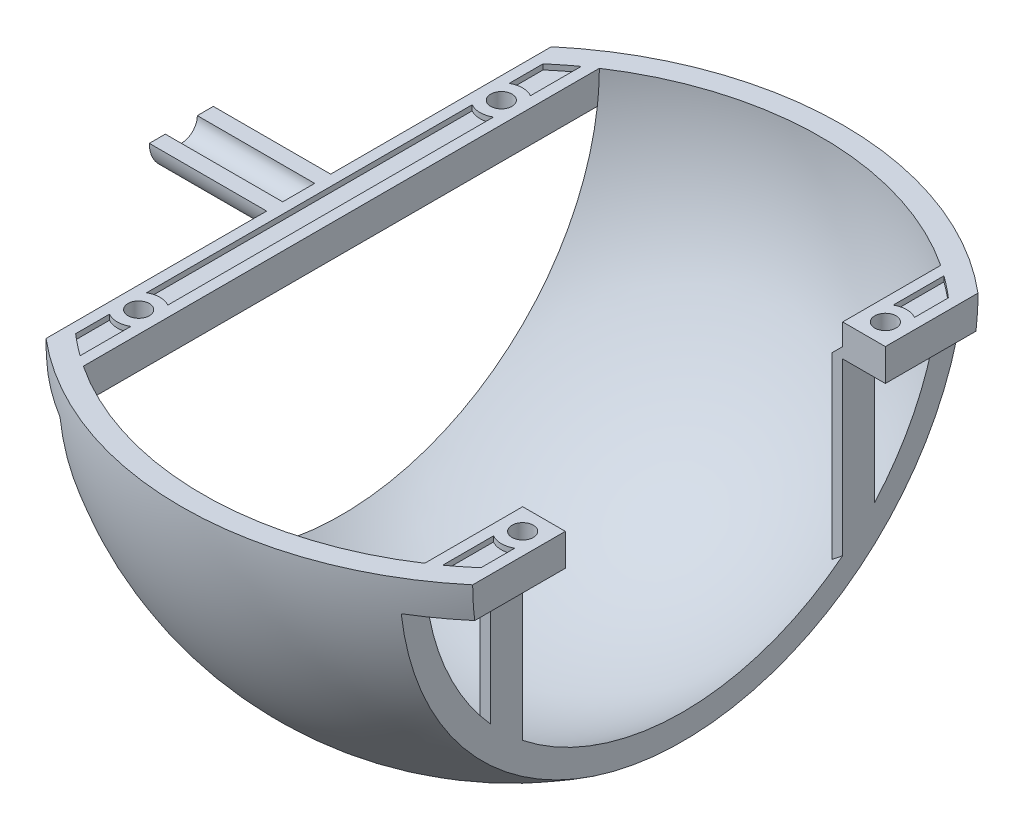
ISO-10303-21;
HEADER;
FILE_DESCRIPTION(('STEP AP214'),'2;1');
FILE_NAME('part.step','',(''),(''),'','','');
FILE_SCHEMA(('AUTOMOTIVE_DESIGN { 1 0 10303 214 1 1 1 1 }'));
ENDSEC;
DATA;
#1=APPLICATION_CONTEXT('core data for automotive mechanical design processes');
#2=APPLICATION_PROTOCOL_DEFINITION('international standard','automotive_design',2000,#1);
#3=PRODUCT_CONTEXT('',#1,'mechanical');
#4=PRODUCT('Part','Part','',(#3));
#5=PRODUCT_RELATED_PRODUCT_CATEGORY('part','',(#4));
#6=PRODUCT_DEFINITION_FORMATION('','',#4);
#7=PRODUCT_DEFINITION_CONTEXT('part definition',#1,'design');
#8=PRODUCT_DEFINITION('design','',#6,#7);
#9=PRODUCT_DEFINITION_SHAPE('','',#8);
#10=(LENGTH_UNIT() NAMED_UNIT(*) SI_UNIT(.MILLI.,.METRE.));
#11=(NAMED_UNIT(*) PLANE_ANGLE_UNIT() SI_UNIT($,.RADIAN.));
#12=(NAMED_UNIT(*) SI_UNIT($,.STERADIAN.) SOLID_ANGLE_UNIT());
#13=UNCERTAINTY_MEASURE_WITH_UNIT(LENGTH_MEASURE(1.E-05),#10,'distance_accuracy_value','');
#14=(GEOMETRIC_REPRESENTATION_CONTEXT(3) GLOBAL_UNCERTAINTY_ASSIGNED_CONTEXT((#13)) GLOBAL_UNIT_ASSIGNED_CONTEXT((#10,
#11,#12)) REPRESENTATION_CONTEXT('',''));
#15=CARTESIAN_POINT('',(0.,0.,0.));
#16=DIRECTION('',(0.,0.,1.));
#17=DIRECTION('',(1.,0.,0.));
#18=AXIS2_PLACEMENT_3D('',#15,#16,#17);
#19=CARTESIAN_POINT('',(-20.,23.685438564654,0.));
#20=DIRECTION('',(1.,0.,0.));
#21=DIRECTION('',(0.,0.,-1.));
#22=AXIS2_PLACEMENT_3D('',#19,#20,#21);
#23=PLANE('',#22);
#24=CARTESIAN_POINT('',(-20.,0.,0.));
#25=DIRECTION('',(-1.,0.,0.));
#26=DIRECTION('',(0.,0.,1.));
#27=AXIS2_PLACEMENT_3D('',#24,#25,#26);
#28=CIRCLE('',#27,3.);
#29=CARTESIAN_POINT('',(-20.,0.,-3.));
#30=VERTEX_POINT('',#29);
#31=CARTESIAN_POINT('',(-20.,-3.,0.));
#32=VERTEX_POINT('',#31);
#33=EDGE_CURVE('E467',#30,#32,#28,.T.);
#34=ORIENTED_EDGE('',*,*,#33,.F.);
#35=DIRECTION('',(0.,0.,1.));
#36=VECTOR('',#35,1.);
#37=CARTESIAN_POINT('',(-20.,0.,0.));
#38=LINE('',#37,#36);
#39=CARTESIAN_POINT('',(-20.,0.,-23.685438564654));
#40=VERTEX_POINT('',#39);
#41=EDGE_CURVE('E457',#40,#30,#38,.T.);
#42=ORIENTED_EDGE('',*,*,#41,.F.);
#43=CARTESIAN_POINT('',(-20.,0.,0.));
#44=DIRECTION('',(-1.,0.,0.));
#45=DIRECTION('',(0.,0.,1.));
#46=AXIS2_PLACEMENT_3D('',#43,#44,#45);
#47=CIRCLE('',#46,23.685438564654);
#48=CARTESIAN_POINT('',(-20.,-3.,-23.4946802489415));
#49=VERTEX_POINT('',#48);
#50=EDGE_CURVE('E540',#40,#49,#47,.T.);
#51=ORIENTED_EDGE('',*,*,#50,.T.);
#52=DIRECTION('',(0.,0.,1.));
#53=VECTOR('',#52,1.);
#54=CARTESIAN_POINT('',(-20.,-3.,0.));
#55=LINE('',#54,#53);
#56=EDGE_CURVE('E534',#49,#32,#55,.T.);
#57=ORIENTED_EDGE('',*,*,#56,.T.);
#58=EDGE_LOOP('',(#34,#42,#51,#57));
#59=FACE_BOUND('',#58,.T.);
#60=ADVANCED_FACE('F31',(#59),#23,.F.);
#61=CARTESIAN_POINT('',(-20.,0.,3.));
#62=VERTEX_POINT('',#61);
#63=EDGE_CURVE('E11',#32,#62,#28,.T.);
#64=ORIENTED_EDGE('',*,*,#63,.F.);
#65=CARTESIAN_POINT('',(-20.,-3.,23.4946802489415));
#66=VERTEX_POINT('',#65);
#67=EDGE_CURVE('E537',#32,#66,#55,.T.);
#68=ORIENTED_EDGE('',*,*,#67,.T.);
#69=CARTESIAN_POINT('',(-20.,0.,23.685438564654));
#70=VERTEX_POINT('',#69);
#71=EDGE_CURVE('E542',#66,#70,#47,.T.);
#72=ORIENTED_EDGE('',*,*,#71,.T.);
#73=EDGE_CURVE('E48',#62,#70,#38,.T.);
#74=ORIENTED_EDGE('',*,*,#73,.F.);
#75=EDGE_LOOP('',(#64,#68,#72,#74));
#76=FACE_BOUND('',#75,.T.);
#77=ADVANCED_FACE('F1024',(#76),#23,.F.);
#78=CARTESIAN_POINT('',(-20.,0.,0.));
#79=DIRECTION('',(1.,0.,0.));
#80=DIRECTION('',(0.,0.,1.));
#81=AXIS2_PLACEMENT_3D('',#78,#79,#80);
#82=CIRCLE('',#81,1.5);
#83=CARTESIAN_POINT('',(-20.,0.,1.5));
#84=VERTEX_POINT('',#83);
#85=CARTESIAN_POINT('',(-20.,0.,-1.5));
#86=VERTEX_POINT('',#85);
#87=EDGE_CURVE('E54',#84,#86,#82,.T.);
#88=ORIENTED_EDGE('',*,*,#87,.F.);
#89=EDGE_CURVE('E451',#86,#84,#38,.T.);
#90=ORIENTED_EDGE('',*,*,#89,.F.);
#91=EDGE_LOOP('',(#88,#90));
#92=FACE_BOUND('',#91,.T.);
#93=ADVANCED_FACE('F452',(#92),#23,.F.);
#94=CARTESIAN_POINT('',(16.,-24.1867732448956,0.));
#95=DIRECTION('',(-1.,0.,0.));
#96=DIRECTION('',(0.,0.,1.));
#97=AXIS2_PLACEMENT_3D('',#94,#95,#96);
#98=PLANE('',#97);
#99=DIRECTION('',(0.,0.,1.));
#100=VECTOR('',#99,1.);
#101=CARTESIAN_POINT('',(16.,-2.,15.));
#102=LINE('',#101,#100);
#103=CARTESIAN_POINT('',(16.,-2.,15.));
#104=VERTEX_POINT('',#103);
#105=CARTESIAN_POINT('',(16.,-2.,18.));
#106=VERTEX_POINT('',#105);
#107=EDGE_CURVE('E815',#104,#106,#102,.T.);
#108=ORIENTED_EDGE('',*,*,#107,.T.);
#109=DIRECTION('',(0.,1.,0.));
#110=VECTOR('',#109,1.);
#111=CARTESIAN_POINT('',(16.,-500000.,18.));
#112=LINE('',#111,#110);
#113=CARTESIAN_POINT('',(16.,-3.,18.));
#114=VERTEX_POINT('',#113);
#115=EDGE_CURVE('E814',#114,#106,#112,.T.);
#116=ORIENTED_EDGE('',*,*,#115,.F.);
#117=DIRECTION('',(0.,0.,1.));
#118=VECTOR('',#117,1.);
#119=CARTESIAN_POINT('',(16.,-3.,-31.));
#120=LINE('',#119,#118);
#121=CARTESIAN_POINT('',(16.,-3.,24.));
#122=VERTEX_POINT('',#121);
#123=EDGE_CURVE('E581',#114,#122,#120,.T.);
#124=ORIENTED_EDGE('',*,*,#123,.T.);
#125=CARTESIAN_POINT('',(16.,0.,0.));
#126=DIRECTION('',(1.,0.,0.));
#127=DIRECTION('',(0.,0.,-1.));
#128=AXIS2_PLACEMENT_3D('',#125,#126,#127);
#129=CIRCLE('',#128,24.1867732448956);
#130=CARTESIAN_POINT('',(16.,0.,24.1867732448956));
#131=VERTEX_POINT('',#130);
#132=EDGE_CURVE('E600',#131,#122,#129,.T.);
#133=ORIENTED_EDGE('',*,*,#132,.F.);
#134=DIRECTION('',(0.,0.,1.));
#135=VECTOR('',#134,1.);
#136=CARTESIAN_POINT('',(16.,0.,37.5162573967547));
#137=LINE('',#136,#135);
#138=CARTESIAN_POINT('',(16.,0.,15.));
#139=VERTEX_POINT('',#138);
#140=EDGE_CURVE('E593',#139,#131,#137,.T.);
#141=ORIENTED_EDGE('',*,*,#140,.F.);
#142=DIRECTION('',(0.,-1.,0.));
#143=VECTOR('',#142,1.);
#144=CARTESIAN_POINT('',(16.,0.,15.));
#145=LINE('',#144,#143);
#146=EDGE_CURVE('E616',#139,#104,#145,.T.);
#147=ORIENTED_EDGE('',*,*,#146,.T.);
#148=EDGE_LOOP('',(#108,#116,#124,#133,#141,#147));
#149=FACE_BOUND('',#148,.T.);
#150=ADVANCED_FACE('F1094',(#149),#98,.T.);
#151=CARTESIAN_POINT('',(0.,0.,0.));
#152=DIRECTION('',(1.,0.,0.));
#153=DIRECTION('',(0.,-1.,0.));
#154=AXIS2_PLACEMENT_3D('',#151,#152,#153);
#155=SPHERICAL_SURFACE('',#154,29.);
#156=CARTESIAN_POINT('',(16.,-16.1554944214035,18.));
#157=VERTEX_POINT('',#156);
#158=EDGE_CURVE('E1050',#122,#157,#129,.T.);
#159=ORIENTED_EDGE('',*,*,#158,.T.);
#160=CARTESIAN_POINT('',(0.,0.,18.));
#161=DIRECTION('',(0.,0.,-1.));
#162=DIRECTION('',(-1.,0.,0.));
#163=AXIS2_PLACEMENT_3D('',#160,#161,#162);
#164=CIRCLE('',#163,22.7376340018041);
#165=CARTESIAN_POINT('',(15.,-17.0880074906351,18.));
#166=VERTEX_POINT('',#165);
#167=EDGE_CURVE('E798',#166,#157,#164,.F.);
#168=ORIENTED_EDGE('',*,*,#167,.F.);
#169=CARTESIAN_POINT('',(15.,0.,0.));
#170=DIRECTION('',(1.,0.,0.));
#171=DIRECTION('',(0.,0.,-1.));
#172=AXIS2_PLACEMENT_3D('',#169,#170,#171);
#173=CIRCLE('',#172,24.8193472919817);
#174=CARTESIAN_POINT('',(15.,-19.7737199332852,15.));
#175=VERTEX_POINT('',#174);
#176=EDGE_CURVE('E801',#175,#166,#173,.F.);
#177=ORIENTED_EDGE('',*,*,#176,.F.);
#178=CARTESIAN_POINT('',(0.,0.,15.));
#179=DIRECTION('',(0.,0.,1.));
#180=DIRECTION('',(1.,0.,0.));
#181=AXIS2_PLACEMENT_3D('',#178,#179,#180);
#182=CIRCLE('',#181,24.8193472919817);
#183=CARTESIAN_POINT('',(16.,-18.9736659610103,15.));
#184=VERTEX_POINT('',#183);
#185=EDGE_CURVE('E797',#184,#175,#182,.F.);
#186=ORIENTED_EDGE('',*,*,#185,.F.);
#187=CARTESIAN_POINT('',(16.,-18.9736659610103,-15.));
#188=VERTEX_POINT('',#187);
#189=EDGE_CURVE('E599',#184,#188,#129,.T.);
#190=ORIENTED_EDGE('',*,*,#189,.T.);
#191=CARTESIAN_POINT('',(0.,0.,-15.));
#192=DIRECTION('',(0.,0.,1.));
#193=DIRECTION('',(1.,0.,0.));
#194=AXIS2_PLACEMENT_3D('',#191,#192,#193);
#195=CIRCLE('',#194,24.8193472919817);
#196=CARTESIAN_POINT('',(15.,-19.7737199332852,-15.));
#197=VERTEX_POINT('',#196);
#198=EDGE_CURVE('E713',#188,#197,#195,.F.);
#199=ORIENTED_EDGE('',*,*,#198,.T.);
#200=CARTESIAN_POINT('',(15.,0.,0.));
#201=DIRECTION('',(-1.,0.,0.));
#202=DIRECTION('',(0.,0.,1.));
#203=AXIS2_PLACEMENT_3D('',#200,#201,#202);
#204=CIRCLE('',#203,24.8193472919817);
#205=CARTESIAN_POINT('',(15.,-17.0880074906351,-18.));
#206=VERTEX_POINT('',#205);
#207=EDGE_CURVE('E715',#197,#206,#204,.F.);
#208=ORIENTED_EDGE('',*,*,#207,.T.);
#209=CARTESIAN_POINT('',(0.,0.,-18.));
#210=DIRECTION('',(0.,0.,-1.));
#211=DIRECTION('',(-1.,0.,0.));
#212=AXIS2_PLACEMENT_3D('',#209,#210,#211);
#213=CIRCLE('',#212,22.7376340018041);
#214=CARTESIAN_POINT('',(16.,-16.1554944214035,-18.));
#215=VERTEX_POINT('',#214);
#216=EDGE_CURVE('E730',#206,#215,#213,.F.);
#217=ORIENTED_EDGE('',*,*,#216,.T.);
#218=CARTESIAN_POINT('',(16.,-3.,-24.));
#219=VERTEX_POINT('',#218);
#220=EDGE_CURVE('E597',#215,#219,#129,.T.);
#221=ORIENTED_EDGE('',*,*,#220,.T.);
#222=CARTESIAN_POINT('',(16.,0.,-24.1867732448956));
#223=VERTEX_POINT('',#222);
#224=EDGE_CURVE('E594',#219,#223,#129,.T.);
#225=ORIENTED_EDGE('',*,*,#224,.T.);
#226=CARTESIAN_POINT('',(0.,0.,0.));
#227=DIRECTION('',(0.,1.,0.));
#228=DIRECTION('',(0.,0.,1.));
#229=AXIS2_PLACEMENT_3D('',#226,#227,#228);
#230=CIRCLE('',#229,29.);
#231=CARTESIAN_POINT('',(-16.,0.,-24.1867732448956));
#232=VERTEX_POINT('',#231);
#233=EDGE_CURVE('E586',#232,#223,#230,.F.);
#234=ORIENTED_EDGE('',*,*,#233,.F.);
#235=CARTESIAN_POINT('',(-16.,0.,0.));
#236=DIRECTION('',(1.,0.,0.));
#237=DIRECTION('',(0.,0.,-1.));
#238=AXIS2_PLACEMENT_3D('',#235,#236,#237);
#239=CIRCLE('',#238,24.1867732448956);
#240=CARTESIAN_POINT('',(-16.,-3.,-24.));
#241=VERTEX_POINT('',#240);
#242=EDGE_CURVE('E601',#241,#232,#239,.T.);
#243=ORIENTED_EDGE('',*,*,#242,.F.);
#244=CARTESIAN_POINT('',(-16.,-3.,24.));
#245=VERTEX_POINT('',#244);
#246=EDGE_CURVE('E603',#245,#241,#239,.T.);
#247=ORIENTED_EDGE('',*,*,#246,.F.);
#248=CARTESIAN_POINT('',(-16.,0.,24.1867732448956));
#249=VERTEX_POINT('',#248);
#250=EDGE_CURVE('E598',#249,#245,#239,.T.);
#251=ORIENTED_EDGE('',*,*,#250,.F.);
#252=EDGE_CURVE('E587',#131,#249,#230,.F.);
#253=ORIENTED_EDGE('',*,*,#252,.F.);
#254=ORIENTED_EDGE('',*,*,#132,.T.);
#255=EDGE_LOOP('',(#159,#168,#177,#186,#190,#199,#208,#217,#221,#225,#234,#243,#247,#251,#253,#254));
#256=FACE_BOUND('',#255,.T.);
#257=ADVANCED_FACE('F1044',(#256),#155,.F.);
#258=CARTESIAN_POINT('',(20.,-3.,-31.));
#259=DIRECTION('',(0.,1.,0.));
#260=DIRECTION('',(-1.,0.,0.));
#261=AXIS2_PLACEMENT_3D('',#258,#259,#260);
#262=PLANE('',#261);
#263=DIRECTION('',(-1.,0.,0.));
#264=VECTOR('',#263,1.);
#265=CARTESIAN_POINT('',(20.001,-3.,15.));
#266=LINE('',#265,#264);
#267=CARTESIAN_POINT('',(20.,-3.,15.));
#268=VERTEX_POINT('',#267);
#269=CARTESIAN_POINT('',(16.,-3.00000000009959,15.));
#270=VERTEX_POINT('',#269);
#271=EDGE_CURVE('E604',#268,#270,#266,.T.);
#272=ORIENTED_EDGE('',*,*,#271,.F.);
#273=DIRECTION('',(0.,0.,-1.));
#274=VECTOR('',#273,1.);
#275=CARTESIAN_POINT('',(20.,-3.,0.));
#276=LINE('',#275,#274);
#277=CARTESIAN_POINT('',(20.,-3.,23.4946802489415));
#278=VERTEX_POINT('',#277);
#279=EDGE_CURVE('E527',#278,#268,#276,.T.);
#280=ORIENTED_EDGE('',*,*,#279,.F.);
#281=CARTESIAN_POINT('',(0.,-3.,0.));
#282=DIRECTION('',(0.,1.,0.));
#283=DIRECTION('',(-1.,0.,0.));
#284=AXIS2_PLACEMENT_3D('',#281,#282,#283);
#285=CIRCLE('',#284,30.854497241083);
#286=CARTESIAN_POINT('',(16.,-3.,26.3818119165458));
#287=VERTEX_POINT('',#286);
#288=EDGE_CURVE('E557',#287,#278,#285,.T.);
#289=ORIENTED_EDGE('',*,*,#288,.F.);
#290=EDGE_CURVE('E585',#122,#287,#120,.T.);
#291=ORIENTED_EDGE('',*,*,#290,.F.);
#292=ORIENTED_EDGE('',*,*,#123,.F.);
#293=EDGE_CURVE('E1069',#270,#114,#120,.T.);
#294=ORIENTED_EDGE('',*,*,#293,.F.);
#295=EDGE_LOOP('',(#272,#280,#289,#291,#292,#294));
#296=FACE_BOUND('',#295,.T.);
#297=CARTESIAN_POINT('',(18.,-3.,17.));
#298=DIRECTION('',(0.,1.,0.));
#299=DIRECTION('',(-1.,0.,0.));
#300=AXIS2_PLACEMENT_3D('',#297,#298,#299);
#301=CIRCLE('',#300,1.);
#302=CARTESIAN_POINT('',(17.,-3.,17.));
#303=VERTEX_POINT('',#302);
#304=EDGE_CURVE('E629',#303,#303,#301,.F.);
#305=ORIENTED_EDGE('',*,*,#304,.F.);
#306=EDGE_LOOP('',(#305));
#307=FACE_BOUND('',#306,.T.);
#308=CARTESIAN_POINT('',(18.,-3.,17.));
#309=DIRECTION('',(0.,-1.,0.));
#310=DIRECTION('',(1.,0.,0.));
#311=AXIS2_PLACEMENT_3D('',#308,#309,#310);
#312=CIRCLE('',#311,2.);
#313=CARTESIAN_POINT('',(19.,-3.,18.7320508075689));
#314=VERTEX_POINT('',#313);
#315=CARTESIAN_POINT('',(17.,-3.,18.7320508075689));
#316=VERTEX_POINT('',#315);
#317=EDGE_CURVE('E794',#314,#316,#312,.T.);
#318=ORIENTED_EDGE('',*,*,#317,.T.);
#319=DIRECTION('',(0.,0.,1.));
#320=VECTOR('',#319,1.);
#321=CARTESIAN_POINT('',(17.,-3.,18.7320508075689));
#322=LINE('',#321,#320);
#323=CARTESIAN_POINT('',(17.,-3.,23.4946802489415));
#324=VERTEX_POINT('',#323);
#325=EDGE_CURVE('E785',#316,#324,#322,.T.);
#326=ORIENTED_EDGE('',*,*,#325,.T.);
#327=CARTESIAN_POINT('',(0.,-3.,0.));
#328=DIRECTION('',(0.,1.,0.));
#329=DIRECTION('',(1.,0.,0.));
#330=AXIS2_PLACEMENT_3D('',#327,#328,#329);
#331=CIRCLE('',#330,29.);
#332=CARTESIAN_POINT('',(19.,-3.,21.9089023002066));
#333=VERTEX_POINT('',#332);
#334=EDGE_CURVE('E788',#324,#333,#331,.T.);
#335=ORIENTED_EDGE('',*,*,#334,.T.);
#336=DIRECTION('',(0.,0.,-1.));
#337=VECTOR('',#336,1.);
#338=CARTESIAN_POINT('',(19.,-3.,21.9089023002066));
#339=LINE('',#338,#337);
#340=EDGE_CURVE('E791',#333,#314,#339,.T.);
#341=ORIENTED_EDGE('',*,*,#340,.T.);
#342=EDGE_LOOP('',(#318,#326,#335,#341));
#343=FACE_BOUND('',#342,.T.);
#344=ADVANCED_FACE('F1074',(#296,#307,#343),#262,.F.);
#345=CARTESIAN_POINT('',(145.467838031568,0.,37.5162573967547));
#346=DIRECTION('',(0.,1.,0.));
#347=DIRECTION('',(0.,0.,1.));
#348=AXIS2_PLACEMENT_3D('',#345,#346,#347);
#349=PLANE('',#348);
#350=CARTESIAN_POINT('',(0.,0.,0.));
#351=DIRECTION('',(0.,1.,0.));
#352=DIRECTION('',(0.,0.,1.));
#353=AXIS2_PLACEMENT_3D('',#350,#351,#352);
#354=CIRCLE('',#353,29.);
#355=CARTESIAN_POINT('',(-17.,0.,-23.4946802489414));
#356=VERTEX_POINT('',#355);
#357=CARTESIAN_POINT('',(-19.,0.,-21.9089023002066));
#358=VERTEX_POINT('',#357);
#359=EDGE_CURVE('E915',#356,#358,#354,.T.);
#360=ORIENTED_EDGE('',*,*,#359,.F.);
#361=DIRECTION('',(0.,0.,-1.));
#362=VECTOR('',#361,1.);
#363=CARTESIAN_POINT('',(-17.,0.,-18.7320508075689));
#364=LINE('',#363,#362);
#365=CARTESIAN_POINT('',(-17.,0.,-18.7320508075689));
#366=VERTEX_POINT('',#365);
#367=EDGE_CURVE('E906',#366,#356,#364,.T.);
#368=ORIENTED_EDGE('',*,*,#367,.F.);
#369=CARTESIAN_POINT('',(-18.,0.,-17.));
#370=DIRECTION('',(0.,-1.,0.));
#371=DIRECTION('',(0.,0.,1.));
#372=AXIS2_PLACEMENT_3D('',#369,#370,#371);
#373=CIRCLE('',#372,2.);
#374=CARTESIAN_POINT('',(-19.,0.,-18.7320508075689));
#375=VERTEX_POINT('',#374);
#376=EDGE_CURVE('E909',#375,#366,#373,.T.);
#377=ORIENTED_EDGE('',*,*,#376,.F.);
#378=DIRECTION('',(0.,0.,1.));
#379=VECTOR('',#378,1.);
#380=CARTESIAN_POINT('',(-19.,0.,-21.9089023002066));
#381=LINE('',#380,#379);
#382=EDGE_CURVE('E912',#358,#375,#381,.T.);
#383=ORIENTED_EDGE('',*,*,#382,.F.);
#384=EDGE_LOOP('',(#360,#368,#377,#383));
#385=FACE_BOUND('',#384,.T.);
#386=CARTESIAN_POINT('',(0.,0.,0.));
#387=DIRECTION('',(0.,1.,0.));
#388=DIRECTION('',(0.,0.,1.));
#389=AXIS2_PLACEMENT_3D('',#386,#387,#388);
#390=CIRCLE('',#389,29.);
#391=CARTESIAN_POINT('',(-19.,0.,21.9089023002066));
#392=VERTEX_POINT('',#391);
#393=CARTESIAN_POINT('',(-17.,0.,23.4946802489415));
#394=VERTEX_POINT('',#393);
#395=EDGE_CURVE('E883',#392,#394,#390,.T.);
#396=ORIENTED_EDGE('',*,*,#395,.F.);
#397=DIRECTION('',(0.,0.,1.));
#398=VECTOR('',#397,1.);
#399=CARTESIAN_POINT('',(-19.,0.,18.7320508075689));
#400=LINE('',#399,#398);
#401=CARTESIAN_POINT('',(-19.,0.,18.7320508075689));
#402=VERTEX_POINT('',#401);
#403=EDGE_CURVE('E874',#402,#392,#400,.T.);
#404=ORIENTED_EDGE('',*,*,#403,.F.);
#405=CARTESIAN_POINT('',(-18.,0.,17.));
#406=DIRECTION('',(0.,-1.,0.));
#407=DIRECTION('',(0.,0.,1.));
#408=AXIS2_PLACEMENT_3D('',#405,#406,#407);
#409=CIRCLE('',#408,2.);
#410=CARTESIAN_POINT('',(-17.,0.,18.7320508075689));
#411=VERTEX_POINT('',#410);
#412=EDGE_CURVE('E877',#411,#402,#409,.T.);
#413=ORIENTED_EDGE('',*,*,#412,.F.);
#414=DIRECTION('',(0.,0.,-1.));
#415=VECTOR('',#414,1.);
#416=CARTESIAN_POINT('',(-17.,0.,23.4946802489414));
#417=LINE('',#416,#415);
#418=EDGE_CURVE('E880',#394,#411,#417,.T.);
#419=ORIENTED_EDGE('',*,*,#418,.F.);
#420=EDGE_LOOP('',(#396,#404,#413,#419));
#421=FACE_BOUND('',#420,.T.);
#422=CARTESIAN_POINT('',(-18.,0.,-17.));
#423=DIRECTION('',(0.,-1.,0.));
#424=DIRECTION('',(0.,0.,1.));
#425=AXIS2_PLACEMENT_3D('',#422,#423,#424);
#426=CIRCLE('',#425,2.);
#427=CARTESIAN_POINT('',(-17.,0.,-15.2679491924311));
#428=VERTEX_POINT('',#427);
#429=CARTESIAN_POINT('',(-19.,0.,-15.2679491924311));
#430=VERTEX_POINT('',#429);
#431=EDGE_CURVE('E851',#428,#430,#426,.T.);
#432=ORIENTED_EDGE('',*,*,#431,.F.);
#433=DIRECTION('',(0.,0.,-1.));
#434=VECTOR('',#433,1.);
#435=CARTESIAN_POINT('',(-17.,0.,15.2679491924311));
#436=LINE('',#435,#434);
#437=CARTESIAN_POINT('',(-17.,0.,15.2679491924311));
#438=VERTEX_POINT('',#437);
#439=EDGE_CURVE('E842',#438,#428,#436,.T.);
#440=ORIENTED_EDGE('',*,*,#439,.F.);
#441=CARTESIAN_POINT('',(-18.,0.,17.));
#442=DIRECTION('',(0.,-1.,0.));
#443=DIRECTION('',(0.,0.,1.));
#444=AXIS2_PLACEMENT_3D('',#441,#442,#443);
#445=CIRCLE('',#444,2.);
#446=CARTESIAN_POINT('',(-19.,0.,15.2679491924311));
#447=VERTEX_POINT('',#446);
#448=EDGE_CURVE('E845',#447,#438,#445,.T.);
#449=ORIENTED_EDGE('',*,*,#448,.F.);
#450=DIRECTION('',(0.,0.,1.));
#451=VECTOR('',#450,1.);
#452=CARTESIAN_POINT('',(-19.,0.,-15.2679491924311));
#453=LINE('',#452,#451);
#454=EDGE_CURVE('E848',#430,#447,#453,.T.);
#455=ORIENTED_EDGE('',*,*,#454,.F.);
#456=EDGE_LOOP('',(#432,#440,#449,#455));
#457=FACE_BOUND('',#456,.T.);
#458=CARTESIAN_POINT('',(-18.,0.,17.));
#459=DIRECTION('',(0.,-1.,0.));
#460=DIRECTION('',(0.,0.,1.));
#461=AXIS2_PLACEMENT_3D('',#458,#459,#460);
#462=CIRCLE('',#461,1.);
#463=CARTESIAN_POINT('',(-18.,0.,18.));
#464=VERTEX_POINT('',#463);
#465=EDGE_CURVE('E639',#464,#464,#462,.T.);
#466=ORIENTED_EDGE('',*,*,#465,.T.);
#467=EDGE_LOOP('',(#466));
#468=FACE_BOUND('',#467,.T.);
#469=DIRECTION('',(0.,0.,-1.));
#470=VECTOR('',#469,1.);
#471=CARTESIAN_POINT('',(20.,0.,0.));
#472=LINE('',#471,#470);
#473=CARTESIAN_POINT('',(20.,0.,23.685438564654));
#474=VERTEX_POINT('',#473);
#475=CARTESIAN_POINT('',(20.,0.,15.));
#476=VERTEX_POINT('',#475);
#477=EDGE_CURVE('E538',#474,#476,#472,.T.);
#478=ORIENTED_EDGE('',*,*,#477,.T.);
#479=DIRECTION('',(-1.,0.,0.));
#480=VECTOR('',#479,1.);
#481=CARTESIAN_POINT('',(20.001,0.,15.));
#482=LINE('',#481,#480);
#483=EDGE_CURVE('E612',#476,#139,#482,.T.);
#484=ORIENTED_EDGE('',*,*,#483,.T.);
#485=ORIENTED_EDGE('',*,*,#140,.T.);
#486=ORIENTED_EDGE('',*,*,#252,.T.);
#487=DIRECTION('',(0.,0.,-1.));
#488=VECTOR('',#487,1.);
#489=CARTESIAN_POINT('',(-16.,0.,37.5162573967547));
#490=LINE('',#489,#488);
#491=EDGE_CURVE('E582',#249,#232,#490,.T.);
#492=ORIENTED_EDGE('',*,*,#491,.T.);
#493=ORIENTED_EDGE('',*,*,#233,.T.);
#494=CARTESIAN_POINT('',(16.,0.,-15.));
#495=VERTEX_POINT('',#494);
#496=EDGE_CURVE('E590',#223,#495,#137,.T.);
#497=ORIENTED_EDGE('',*,*,#496,.T.);
#498=DIRECTION('',(-1.,0.,0.));
#499=VECTOR('',#498,1.);
#500=CARTESIAN_POINT('',(20.001,0.,-15.));
#501=LINE('',#500,#499);
#502=CARTESIAN_POINT('',(20.,0.,-15.));
#503=VERTEX_POINT('',#502);
#504=EDGE_CURVE('E609',#503,#495,#501,.T.);
#505=ORIENTED_EDGE('',*,*,#504,.F.);
#506=CARTESIAN_POINT('',(20.,0.,-23.685438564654));
#507=VERTEX_POINT('',#506);
#508=EDGE_CURVE('E539',#503,#507,#472,.T.);
#509=ORIENTED_EDGE('',*,*,#508,.T.);
#510=CARTESIAN_POINT('',(0.,0.,0.));
#511=DIRECTION('',(0.,1.,0.));
#512=DIRECTION('',(0.,0.,1.));
#513=AXIS2_PLACEMENT_3D('',#510,#511,#512);
#514=CIRCLE('',#513,31.);
#515=EDGE_CURVE('E498',#507,#40,#514,.T.);
#516=ORIENTED_EDGE('',*,*,#515,.T.);
#517=ORIENTED_EDGE('',*,*,#41,.T.);
#518=DIRECTION('',(1.,0.,0.));
#519=VECTOR('',#518,1.);
#520=CARTESIAN_POINT('',(-31.,0.,-3.));
#521=LINE('',#520,#519);
#522=CARTESIAN_POINT('',(-31.,0.,-3.));
#523=VERTEX_POINT('',#522);
#524=EDGE_CURVE('E474',#523,#30,#521,.T.);
#525=ORIENTED_EDGE('',*,*,#524,.F.);
#526=DIRECTION('',(0.,0.,-1.));
#527=VECTOR('',#526,1.);
#528=CARTESIAN_POINT('',(-31.,0.,-3.));
#529=LINE('',#528,#527);
#530=CARTESIAN_POINT('',(-31.,0.,-1.5));
#531=VERTEX_POINT('',#530);
#532=EDGE_CURVE('E473',#531,#523,#529,.T.);
#533=ORIENTED_EDGE('',*,*,#532,.F.);
#534=DIRECTION('',(1.,0.,0.));
#535=VECTOR('',#534,1.);
#536=CARTESIAN_POINT('',(-31.,0.,-1.5));
#537=LINE('',#536,#535);
#538=EDGE_CURVE('E463',#531,#86,#537,.T.);
#539=ORIENTED_EDGE('',*,*,#538,.T.);
#540=ORIENTED_EDGE('',*,*,#89,.T.);
#541=DIRECTION('',(1.,0.,0.));
#542=VECTOR('',#541,1.);
#543=CARTESIAN_POINT('',(-31.,0.,1.5));
#544=LINE('',#543,#542);
#545=CARTESIAN_POINT('',(-31.,0.,1.5));
#546=VERTEX_POINT('',#545);
#547=EDGE_CURVE('E465',#546,#84,#544,.T.);
#548=ORIENTED_EDGE('',*,*,#547,.F.);
#549=DIRECTION('',(0.,0.,-1.));
#550=VECTOR('',#549,1.);
#551=CARTESIAN_POINT('',(-31.,0.,1.5));
#552=LINE('',#551,#550);
#553=CARTESIAN_POINT('',(-31.,0.,3.));
#554=VERTEX_POINT('',#553);
#555=EDGE_CURVE('E1015',#554,#546,#552,.T.);
#556=ORIENTED_EDGE('',*,*,#555,.F.);
#557=DIRECTION('',(1.,0.,0.));
#558=VECTOR('',#557,1.);
#559=CARTESIAN_POINT('',(-31.,0.,3.));
#560=LINE('',#559,#558);
#561=EDGE_CURVE('E476',#554,#62,#560,.T.);
#562=ORIENTED_EDGE('',*,*,#561,.T.);
#563=ORIENTED_EDGE('',*,*,#73,.T.);
#564=EDGE_CURVE('E503',#70,#474,#514,.T.);
#565=ORIENTED_EDGE('',*,*,#564,.T.);
#566=EDGE_LOOP('',(#478,#484,#485,#486,#492,#493,#497,#505,#509,#516,#517,#525,#533,#539,#540,
#548,#556,#562,#563,#565));
#567=FACE_BOUND('',#566,.T.);
#568=CARTESIAN_POINT('',(18.,0.,-17.));
#569=DIRECTION('',(0.,1.,0.));
#570=DIRECTION('',(0.,0.,1.));
#571=AXIS2_PLACEMENT_3D('',#568,#569,#570);
#572=CIRCLE('',#571,1.);
#573=CARTESIAN_POINT('',(18.,0.,-16.));
#574=VERTEX_POINT('',#573);
#575=EDGE_CURVE('E626',#574,#574,#572,.T.);
#576=ORIENTED_EDGE('',*,*,#575,.F.);
#577=EDGE_LOOP('',(#576));
#578=FACE_BOUND('',#577,.T.);
#579=CARTESIAN_POINT('',(18.,0.,17.));
#580=DIRECTION('',(0.,1.,0.));
#581=DIRECTION('',(0.,0.,1.));
#582=AXIS2_PLACEMENT_3D('',#579,#580,#581);
#583=CIRCLE('',#582,1.);
#584=CARTESIAN_POINT('',(18.,0.,18.));
#585=VERTEX_POINT('',#584);
#586=EDGE_CURVE('E632',#585,#585,#583,.T.);
#587=ORIENTED_EDGE('',*,*,#586,.F.);
#588=EDGE_LOOP('',(#587));
#589=FACE_BOUND('',#588,.T.);
#590=CARTESIAN_POINT('',(-18.,0.,-17.));
#591=DIRECTION('',(0.,-1.,0.));
#592=DIRECTION('',(0.,0.,1.));
#593=AXIS2_PLACEMENT_3D('',#590,#591,#592);
#594=CIRCLE('',#593,1.);
#595=CARTESIAN_POINT('',(-18.,0.,-16.));
#596=VERTEX_POINT('',#595);
#597=EDGE_CURVE('E635',#596,#596,#594,.T.);
#598=ORIENTED_EDGE('',*,*,#597,.T.);
#599=EDGE_LOOP('',(#598));
#600=FACE_BOUND('',#599,.T.);
#601=CARTESIAN_POINT('',(18.,0.,-17.));
#602=DIRECTION('',(0.,-1.,0.));
#603=DIRECTION('',(0.,0.,1.));
#604=AXIS2_PLACEMENT_3D('',#601,#602,#603);
#605=CIRCLE('',#604,2.);
#606=CARTESIAN_POINT('',(17.,0.,-18.7320508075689));
#607=VERTEX_POINT('',#606);
#608=CARTESIAN_POINT('',(19.,0.,-18.7320508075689));
#609=VERTEX_POINT('',#608);
#610=EDGE_CURVE('E677',#607,#609,#605,.T.);
#611=ORIENTED_EDGE('',*,*,#610,.F.);
#612=DIRECTION('',(0.,0.,1.));
#613=VECTOR('',#612,1.);
#614=CARTESIAN_POINT('',(17.,0.,-23.4946802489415));
#615=LINE('',#614,#613);
#616=CARTESIAN_POINT('',(17.,0.,-23.4946802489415));
#617=VERTEX_POINT('',#616);
#618=EDGE_CURVE('E668',#617,#607,#615,.T.);
#619=ORIENTED_EDGE('',*,*,#618,.F.);
#620=CARTESIAN_POINT('',(0.,0.,0.));
#621=DIRECTION('',(0.,1.,0.));
#622=DIRECTION('',(0.,0.,1.));
#623=AXIS2_PLACEMENT_3D('',#620,#621,#622);
#624=CIRCLE('',#623,29.);
#625=CARTESIAN_POINT('',(19.,0.,-21.9089023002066));
#626=VERTEX_POINT('',#625);
#627=EDGE_CURVE('E671',#626,#617,#624,.T.);
#628=ORIENTED_EDGE('',*,*,#627,.F.);
#629=DIRECTION('',(0.,0.,-1.));
#630=VECTOR('',#629,1.);
#631=CARTESIAN_POINT('',(19.,0.,-18.7320508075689));
#632=LINE('',#631,#630);
#633=EDGE_CURVE('E674',#609,#626,#632,.T.);
#634=ORIENTED_EDGE('',*,*,#633,.F.);
#635=EDGE_LOOP('',(#611,#619,#628,#634));
#636=FACE_BOUND('',#635,.T.);
#637=DIRECTION('',(0.,0.,-1.));
#638=VECTOR('',#637,1.);
#639=CARTESIAN_POINT('',(17.,0.,23.4946802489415));
#640=LINE('',#639,#638);
#641=CARTESIAN_POINT('',(17.,0.,23.4946802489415));
#642=VERTEX_POINT('',#641);
#643=CARTESIAN_POINT('',(17.,0.,18.7320508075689));
#644=VERTEX_POINT('',#643);
#645=EDGE_CURVE('E760',#642,#644,#640,.T.);
#646=ORIENTED_EDGE('',*,*,#645,.T.);
#647=CARTESIAN_POINT('',(18.,0.,17.));
#648=DIRECTION('',(0.,1.,0.));
#649=DIRECTION('',(0.,0.,-1.));
#650=AXIS2_PLACEMENT_3D('',#647,#648,#649);
#651=CIRCLE('',#650,2.);
#652=CARTESIAN_POINT('',(19.,0.,18.7320508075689));
#653=VERTEX_POINT('',#652);
#654=EDGE_CURVE('E763',#644,#653,#651,.T.);
#655=ORIENTED_EDGE('',*,*,#654,.T.);
#656=DIRECTION('',(0.,0.,1.));
#657=VECTOR('',#656,1.);
#658=CARTESIAN_POINT('',(19.,0.,18.7320508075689));
#659=LINE('',#658,#657);
#660=CARTESIAN_POINT('',(19.,0.,21.9089023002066));
#661=VERTEX_POINT('',#660);
#662=EDGE_CURVE('E754',#653,#661,#659,.T.);
#663=ORIENTED_EDGE('',*,*,#662,.T.);
#664=CARTESIAN_POINT('',(0.,0.,0.));
#665=DIRECTION('',(0.,-1.,0.));
#666=DIRECTION('',(0.,0.,-1.));
#667=AXIS2_PLACEMENT_3D('',#664,#665,#666);
#668=CIRCLE('',#667,29.);
#669=EDGE_CURVE('E757',#661,#642,#668,.T.);
#670=ORIENTED_EDGE('',*,*,#669,.T.);
#671=EDGE_LOOP('',(#646,#655,#663,#670));
#672=FACE_BOUND('',#671,.T.);
#673=ADVANCED_FACE('F470',(#385,#421,#457,#468,#567,#578,#589,#600,#636,#672),#349,.T.);
#674=CARTESIAN_POINT('',(-20.,-3.,-31.));
#675=DIRECTION('',(0.,1.,0.));
#676=DIRECTION('',(-1.,0.,0.));
#677=AXIS2_PLACEMENT_3D('',#674,#675,#676);
#678=PLANE('',#677);
#679=DIRECTION('',(0.,0.,-1.));
#680=VECTOR('',#679,1.);
#681=CARTESIAN_POINT('',(-19.,-3.,15.2679491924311));
#682=LINE('',#681,#680);
#683=CARTESIAN_POINT('',(-19.,-3.,15.2679491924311));
#684=VERTEX_POINT('',#683);
#685=CARTESIAN_POINT('',(-19.,-3.,-15.2679491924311));
#686=VERTEX_POINT('',#685);
#687=EDGE_CURVE('E1008',#684,#686,#682,.T.);
#688=ORIENTED_EDGE('',*,*,#687,.F.);
#689=CARTESIAN_POINT('',(-18.,-3.,17.));
#690=DIRECTION('',(0.,1.,0.));
#691=DIRECTION('',(1.,0.,0.));
#692=AXIS2_PLACEMENT_3D('',#689,#690,#691);
#693=CIRCLE('',#692,2.);
#694=CARTESIAN_POINT('',(-17.,-3.,15.2679491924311));
#695=VERTEX_POINT('',#694);
#696=EDGE_CURVE('E487',#695,#684,#693,.T.);
#697=ORIENTED_EDGE('',*,*,#696,.F.);
#698=DIRECTION('',(0.,0.,1.));
#699=VECTOR('',#698,1.);
#700=CARTESIAN_POINT('',(-17.,-3.,-15.2679491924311));
#701=LINE('',#700,#699);
#702=CARTESIAN_POINT('',(-17.,-3.,-15.2679491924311));
#703=VERTEX_POINT('',#702);
#704=EDGE_CURVE('E1002',#703,#695,#701,.T.);
#705=ORIENTED_EDGE('',*,*,#704,.F.);
#706=CARTESIAN_POINT('',(-18.,-3.,-17.));
#707=DIRECTION('',(0.,1.,0.));
#708=DIRECTION('',(1.,0.,0.));
#709=AXIS2_PLACEMENT_3D('',#706,#707,#708);
#710=CIRCLE('',#709,2.);
#711=EDGE_CURVE('E1005',#686,#703,#710,.T.);
#712=ORIENTED_EDGE('',*,*,#711,.F.);
#713=EDGE_LOOP('',(#688,#697,#705,#712));
#714=FACE_BOUND('',#713,.T.);
#715=DIRECTION('',(0.,0.,-1.));
#716=VECTOR('',#715,1.);
#717=CARTESIAN_POINT('',(-19.,-3.,21.9089023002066));
#718=LINE('',#717,#716);
#719=CARTESIAN_POINT('',(-19.,-3.,21.9089023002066));
#720=VERTEX_POINT('',#719);
#721=CARTESIAN_POINT('',(-19.,-3.,18.7320508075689));
#722=VERTEX_POINT('',#721);
#723=EDGE_CURVE('E976',#720,#722,#718,.T.);
#724=ORIENTED_EDGE('',*,*,#723,.F.);
#725=CARTESIAN_POINT('',(0.,-3.00000000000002,0.));
#726=DIRECTION('',(0.,-1.,0.));
#727=DIRECTION('',(1.,0.,0.));
#728=AXIS2_PLACEMENT_3D('',#725,#726,#727);
#729=CIRCLE('',#728,29.);
#730=CARTESIAN_POINT('',(-17.,-3.,23.4946802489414));
#731=VERTEX_POINT('',#730);
#732=EDGE_CURVE('E979',#731,#720,#729,.T.);
#733=ORIENTED_EDGE('',*,*,#732,.F.);
#734=DIRECTION('',(0.,0.,1.));
#735=VECTOR('',#734,1.);
#736=CARTESIAN_POINT('',(-17.,-3.,18.7320508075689));
#737=LINE('',#736,#735);
#738=CARTESIAN_POINT('',(-17.,-3.,18.7320508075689));
#739=VERTEX_POINT('',#738);
#740=EDGE_CURVE('E970',#739,#731,#737,.T.);
#741=ORIENTED_EDGE('',*,*,#740,.F.);
#742=CARTESIAN_POINT('',(-18.,-3.,17.));
#743=DIRECTION('',(0.,1.,0.));
#744=DIRECTION('',(1.,0.,0.));
#745=AXIS2_PLACEMENT_3D('',#742,#743,#744);
#746=CIRCLE('',#745,2.);
#747=EDGE_CURVE('E973',#722,#739,#746,.T.);
#748=ORIENTED_EDGE('',*,*,#747,.F.);
#749=EDGE_LOOP('',(#724,#733,#741,#748));
#750=FACE_BOUND('',#749,.T.);
#751=DIRECTION('',(0.,0.,1.));
#752=VECTOR('',#751,1.);
#753=CARTESIAN_POINT('',(-17.,-3.,-23.4946802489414));
#754=LINE('',#753,#752);
#755=CARTESIAN_POINT('',(-17.,-3.,-23.4946802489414));
#756=VERTEX_POINT('',#755);
#757=CARTESIAN_POINT('',(-17.,-3.,-18.7320508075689));
#758=VERTEX_POINT('',#757);
#759=EDGE_CURVE('E944',#756,#758,#754,.T.);
#760=ORIENTED_EDGE('',*,*,#759,.F.);
#761=CARTESIAN_POINT('',(0.,-3.00000000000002,0.));
#762=DIRECTION('',(0.,-1.,0.));
#763=DIRECTION('',(1.,0.,0.));
#764=AXIS2_PLACEMENT_3D('',#761,#762,#763);
#765=CIRCLE('',#764,29.);
#766=CARTESIAN_POINT('',(-19.,-3.,-21.9089023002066));
#767=VERTEX_POINT('',#766);
#768=EDGE_CURVE('E947',#767,#756,#765,.T.);
#769=ORIENTED_EDGE('',*,*,#768,.F.);
#770=DIRECTION('',(0.,0.,-1.));
#771=VECTOR('',#770,1.);
#772=CARTESIAN_POINT('',(-19.,-3.,-18.7320508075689));
#773=LINE('',#772,#771);
#774=CARTESIAN_POINT('',(-19.,-3.,-18.7320508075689));
#775=VERTEX_POINT('',#774);
#776=EDGE_CURVE('E938',#775,#767,#773,.T.);
#777=ORIENTED_EDGE('',*,*,#776,.F.);
#778=CARTESIAN_POINT('',(-18.,-3.,-17.));
#779=DIRECTION('',(0.,1.,0.));
#780=DIRECTION('',(1.,0.,0.));
#781=AXIS2_PLACEMENT_3D('',#778,#779,#780);
#782=CIRCLE('',#781,2.);
#783=EDGE_CURVE('E941',#758,#775,#782,.T.);
#784=ORIENTED_EDGE('',*,*,#783,.F.);
#785=EDGE_LOOP('',(#760,#769,#777,#784));
#786=FACE_BOUND('',#785,.T.);
#787=CARTESIAN_POINT('',(-18.,-3.,-17.));
#788=DIRECTION('',(0.,1.,0.));
#789=DIRECTION('',(-1.,0.,0.));
#790=AXIS2_PLACEMENT_3D('',#787,#788,#789);
#791=CIRCLE('',#790,1.);
#792=CARTESIAN_POINT('',(-19.,-3.,-17.));
#793=VERTEX_POINT('',#792);
#794=EDGE_CURVE('E636',#793,#793,#791,.T.);
#795=ORIENTED_EDGE('',*,*,#794,.T.);
#796=EDGE_LOOP('',(#795));
#797=FACE_BOUND('',#796,.T.);
#798=ORIENTED_EDGE('',*,*,#56,.F.);
#799=CARTESIAN_POINT('',(0.,-3.00000000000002,0.));
#800=DIRECTION('',(0.,1.,0.));
#801=DIRECTION('',(-1.,0.,0.));
#802=AXIS2_PLACEMENT_3D('',#799,#800,#801);
#803=CIRCLE('',#802,30.854497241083);
#804=CARTESIAN_POINT('',(-16.,-3.,-26.3818119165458));
#805=VERTEX_POINT('',#804);
#806=EDGE_CURVE('E566',#805,#49,#803,.T.);
#807=ORIENTED_EDGE('',*,*,#806,.F.);
#808=DIRECTION('',(0.,0.,1.));
#809=VECTOR('',#808,1.);
#810=CARTESIAN_POINT('',(-16.,-3.,-31.));
#811=LINE('',#810,#809);
#812=EDGE_CURVE('E569',#805,#241,#811,.T.);
#813=ORIENTED_EDGE('',*,*,#812,.T.);
#814=EDGE_CURVE('E573',#241,#245,#811,.T.);
#815=ORIENTED_EDGE('',*,*,#814,.T.);
#816=CARTESIAN_POINT('',(-16.,-3.,26.3818119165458));
#817=VERTEX_POINT('',#816);
#818=EDGE_CURVE('E574',#245,#817,#811,.T.);
#819=ORIENTED_EDGE('',*,*,#818,.T.);
#820=EDGE_CURVE('E563',#66,#817,#803,.T.);
#821=ORIENTED_EDGE('',*,*,#820,.F.);
#822=ORIENTED_EDGE('',*,*,#67,.F.);
#823=EDGE_LOOP('',(#798,#807,#813,#815,#819,#821,#822));
#824=FACE_BOUND('',#823,.T.);
#825=CARTESIAN_POINT('',(-18.,-3.,17.));
#826=DIRECTION('',(0.,1.,0.));
#827=DIRECTION('',(-1.,0.,0.));
#828=AXIS2_PLACEMENT_3D('',#825,#826,#827);
#829=CIRCLE('',#828,1.);
#830=CARTESIAN_POINT('',(-19.,-3.,17.));
#831=VERTEX_POINT('',#830);
#832=EDGE_CURVE('E642',#831,#831,#829,.T.);
#833=ORIENTED_EDGE('',*,*,#832,.T.);
#834=EDGE_LOOP('',(#833));
#835=FACE_BOUND('',#834,.T.);
#836=ADVANCED_FACE('F1026',(#714,#750,#786,#797,#824,#835),#678,.F.);
#837=CARTESIAN_POINT('',(20.,23.685438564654,0.));
#838=DIRECTION('',(-1.,0.,0.));
#839=DIRECTION('',(0.,0.,1.));
#840=AXIS2_PLACEMENT_3D('',#837,#838,#839);
#841=PLANE('',#840);
#842=DIRECTION('',(0.,1.,0.));
#843=VECTOR('',#842,1.);
#844=CARTESIAN_POINT('',(20.,0.,15.));
#845=LINE('',#844,#843);
#846=EDGE_CURVE('E561',#268,#476,#845,.T.);
#847=ORIENTED_EDGE('',*,*,#846,.T.);
#848=ORIENTED_EDGE('',*,*,#477,.F.);
#849=CARTESIAN_POINT('',(20.,0.,0.));
#850=DIRECTION('',(-1.,0.,0.));
#851=DIRECTION('',(0.,0.,1.));
#852=AXIS2_PLACEMENT_3D('',#849,#850,#851);
#853=CIRCLE('',#852,23.685438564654);
#854=EDGE_CURVE('E511',#278,#474,#853,.T.);
#855=ORIENTED_EDGE('',*,*,#854,.F.);
#856=ORIENTED_EDGE('',*,*,#279,.T.);
#857=EDGE_LOOP('',(#847,#848,#855,#856));
#858=FACE_BOUND('',#857,.T.);
#859=ADVANCED_FACE('F560',(#858),#841,.F.);
#860=DIRECTION('',(0.,-1.,0.));
#861=VECTOR('',#860,1.);
#862=CARTESIAN_POINT('',(20.,0.,-15.));
#863=LINE('',#862,#861);
#864=CARTESIAN_POINT('',(20.,-3.,-15.));
#865=VERTEX_POINT('',#864);
#866=EDGE_CURVE('E620',#503,#865,#863,.T.);
#867=ORIENTED_EDGE('',*,*,#866,.T.);
#868=CARTESIAN_POINT('',(20.,-3.,-23.4946802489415));
#869=VERTEX_POINT('',#868);
#870=EDGE_CURVE('E530',#865,#869,#276,.T.);
#871=ORIENTED_EDGE('',*,*,#870,.T.);
#872=EDGE_CURVE('E505',#507,#869,#853,.T.);
#873=ORIENTED_EDGE('',*,*,#872,.F.);
#874=ORIENTED_EDGE('',*,*,#508,.F.);
#875=EDGE_LOOP('',(#867,#871,#873,#874));
#876=FACE_BOUND('',#875,.T.);
#877=ADVANCED_FACE('F1133',(#876),#841,.F.);
#878=DIRECTION('',(0.,0.,-1.));
#879=VECTOR('',#878,1.);
#880=CARTESIAN_POINT('',(17.,-3.,-18.7320508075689));
#881=LINE('',#880,#879);
#882=CARTESIAN_POINT('',(17.,-3.,-18.7320508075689));
#883=VERTEX_POINT('',#882);
#884=CARTESIAN_POINT('',(17.,-3.,-23.4946802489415));
#885=VERTEX_POINT('',#884);
#886=EDGE_CURVE('E706',#883,#885,#881,.T.);
#887=ORIENTED_EDGE('',*,*,#886,.F.);
#888=CARTESIAN_POINT('',(18.,-3.,-17.));
#889=DIRECTION('',(0.,1.,0.));
#890=DIRECTION('',(1.,0.,0.));
#891=AXIS2_PLACEMENT_3D('',#888,#889,#890);
#892=CIRCLE('',#891,2.);
#893=CARTESIAN_POINT('',(19.,-3.,-18.7320508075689));
#894=VERTEX_POINT('',#893);
#895=EDGE_CURVE('E709',#894,#883,#892,.T.);
#896=ORIENTED_EDGE('',*,*,#895,.F.);
#897=DIRECTION('',(0.,0.,1.));
#898=VECTOR('',#897,1.);
#899=CARTESIAN_POINT('',(19.,-3.,-21.9089023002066));
#900=LINE('',#899,#898);
#901=CARTESIAN_POINT('',(19.,-3.,-21.9089023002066));
#902=VERTEX_POINT('',#901);
#903=EDGE_CURVE('E700',#902,#894,#900,.T.);
#904=ORIENTED_EDGE('',*,*,#903,.F.);
#905=CARTESIAN_POINT('',(0.,-3.,0.));
#906=DIRECTION('',(0.,-1.,0.));
#907=DIRECTION('',(1.,0.,0.));
#908=AXIS2_PLACEMENT_3D('',#905,#906,#907);
#909=CIRCLE('',#908,29.);
#910=EDGE_CURVE('E703',#885,#902,#909,.T.);
#911=ORIENTED_EDGE('',*,*,#910,.F.);
#912=EDGE_LOOP('',(#887,#896,#904,#911));
#913=FACE_BOUND('',#912,.T.);
#914=CARTESIAN_POINT('',(18.,-3.,-17.));
#915=DIRECTION('',(0.,1.,0.));
#916=DIRECTION('',(-1.,0.,0.));
#917=AXIS2_PLACEMENT_3D('',#914,#915,#916);
#918=CIRCLE('',#917,1.);
#919=CARTESIAN_POINT('',(17.,-3.,-17.));
#920=VERTEX_POINT('',#919);
#921=EDGE_CURVE('E623',#920,#920,#918,.F.);
#922=ORIENTED_EDGE('',*,*,#921,.F.);
#923=EDGE_LOOP('',(#922));
#924=FACE_BOUND('',#923,.T.);
#925=DIRECTION('',(-1.,0.,0.));
#926=VECTOR('',#925,1.);
#927=CARTESIAN_POINT('',(20.001,-3.,-15.));
#928=LINE('',#927,#926);
#929=CARTESIAN_POINT('',(16.,-3.,-15.));
#930=VERTEX_POINT('',#929);
#931=EDGE_CURVE('E607',#865,#930,#928,.T.);
#932=ORIENTED_EDGE('',*,*,#931,.T.);
#933=DIRECTION('',(0.,0.,-1.));
#934=VECTOR('',#933,1.);
#935=CARTESIAN_POINT('',(16.,-3.,-31.));
#936=LINE('',#935,#934);
#937=CARTESIAN_POINT('',(16.,-3.,-18.));
#938=VERTEX_POINT('',#937);
#939=EDGE_CURVE('E711',#930,#938,#936,.T.);
#940=ORIENTED_EDGE('',*,*,#939,.T.);
#941=EDGE_CURVE('E580',#219,#938,#120,.T.);
#942=ORIENTED_EDGE('',*,*,#941,.F.);
#943=CARTESIAN_POINT('',(16.,-3.,-26.3818119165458));
#944=VERTEX_POINT('',#943);
#945=EDGE_CURVE('E577',#944,#219,#120,.T.);
#946=ORIENTED_EDGE('',*,*,#945,.F.);
#947=EDGE_CURVE('E575',#869,#944,#285,.T.);
#948=ORIENTED_EDGE('',*,*,#947,.F.);
#949=ORIENTED_EDGE('',*,*,#870,.F.);
#950=EDGE_LOOP('',(#932,#940,#942,#946,#948,#949));
#951=FACE_BOUND('',#950,.T.);
#952=ADVANCED_FACE('F1066',(#913,#924,#951),#262,.F.);
#953=DIRECTION('',(0.,1.,0.));
#954=VECTOR('',#953,1.);
#955=CARTESIAN_POINT('',(16.,-500000.,-18.));
#956=LINE('',#955,#954);
#957=CARTESIAN_POINT('',(16.,-2.,-18.));
#958=VERTEX_POINT('',#957);
#959=EDGE_CURVE('E726',#938,#958,#956,.T.);
#960=ORIENTED_EDGE('',*,*,#959,.T.);
#961=DIRECTION('',(0.,0.,-1.));
#962=VECTOR('',#961,1.);
#963=CARTESIAN_POINT('',(16.,-2.,-15.));
#964=LINE('',#963,#962);
#965=CARTESIAN_POINT('',(16.,-2.,-15.));
#966=VERTEX_POINT('',#965);
#967=EDGE_CURVE('E720',#966,#958,#964,.T.);
#968=ORIENTED_EDGE('',*,*,#967,.F.);
#969=DIRECTION('',(0.,1.,0.));
#970=VECTOR('',#969,1.);
#971=CARTESIAN_POINT('',(16.,0.,-15.));
#972=LINE('',#971,#970);
#973=EDGE_CURVE('E614',#966,#495,#972,.T.);
#974=ORIENTED_EDGE('',*,*,#973,.T.);
#975=ORIENTED_EDGE('',*,*,#496,.F.);
#976=ORIENTED_EDGE('',*,*,#224,.F.);
#977=ORIENTED_EDGE('',*,*,#941,.T.);
#978=EDGE_LOOP('',(#960,#968,#974,#975,#976,#977));
#979=FACE_BOUND('',#978,.T.);
#980=ADVANCED_FACE('F1062',(#979),#98,.T.);
#981=CARTESIAN_POINT('',(-16.,-3.,-31.));
#982=DIRECTION('',(1.,0.,0.));
#983=DIRECTION('',(0.,1.,0.));
#984=AXIS2_PLACEMENT_3D('',#981,#982,#983);
#985=PLANE('',#984);
#986=ORIENTED_EDGE('',*,*,#246,.T.);
#987=ORIENTED_EDGE('',*,*,#812,.F.);
#988=CARTESIAN_POINT('',(-16.,0.,0.));
#989=DIRECTION('',(1.,0.,0.));
#990=DIRECTION('',(0.,1.,0.));
#991=AXIS2_PLACEMENT_3D('',#988,#989,#990);
#992=CIRCLE('',#991,26.5518360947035);
#993=EDGE_CURVE('E531',#817,#805,#992,.T.);
#994=ORIENTED_EDGE('',*,*,#993,.F.);
#995=ORIENTED_EDGE('',*,*,#818,.F.);
#996=EDGE_LOOP('',(#986,#987,#994,#995));
#997=FACE_BOUND('',#996,.T.);
#998=ADVANCED_FACE('F1035',(#997),#985,.F.);
#999=CARTESIAN_POINT('',(16.,-3.,-31.));
#1000=DIRECTION('',(-1.,0.,0.));
#1001=DIRECTION('',(0.,-1.,0.));
#1002=AXIS2_PLACEMENT_3D('',#999,#1000,#1001);
#1003=PLANE('',#1002);
#1004=ORIENTED_EDGE('',*,*,#158,.F.);
#1005=ORIENTED_EDGE('',*,*,#290,.T.);
#1006=CARTESIAN_POINT('',(16.,0.,0.));
#1007=DIRECTION('',(-1.,0.,0.));
#1008=DIRECTION('',(0.,-1.,0.));
#1009=AXIS2_PLACEMENT_3D('',#1006,#1007,#1008);
#1010=CIRCLE('',#1009,26.5518360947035);
#1011=EDGE_CURVE('E524',#944,#287,#1010,.T.);
#1012=ORIENTED_EDGE('',*,*,#1011,.F.);
#1013=ORIENTED_EDGE('',*,*,#945,.T.);
#1014=ORIENTED_EDGE('',*,*,#220,.F.);
#1015=EDGE_CURVE('E727',#215,#938,#956,.T.);
#1016=ORIENTED_EDGE('',*,*,#1015,.T.);
#1017=ORIENTED_EDGE('',*,*,#939,.F.);
#1018=DIRECTION('',(0.,1.,0.));
#1019=VECTOR('',#1018,1.);
#1020=CARTESIAN_POINT('',(16.,-500000.,-15.));
#1021=LINE('',#1020,#1019);
#1022=EDGE_CURVE('E716',#188,#930,#1021,.T.);
#1023=ORIENTED_EDGE('',*,*,#1022,.F.);
#1024=ORIENTED_EDGE('',*,*,#189,.F.);
#1025=DIRECTION('',(0.,1.,0.));
#1026=VECTOR('',#1025,1.);
#1027=CARTESIAN_POINT('',(16.,-500000.,15.));
#1028=LINE('',#1027,#1026);
#1029=EDGE_CURVE('E802',#184,#270,#1028,.T.);
#1030=ORIENTED_EDGE('',*,*,#1029,.T.);
#1031=ORIENTED_EDGE('',*,*,#293,.T.);
#1032=EDGE_CURVE('E811',#157,#114,#112,.T.);
#1033=ORIENTED_EDGE('',*,*,#1032,.F.);
#1034=EDGE_LOOP('',(#1004,#1005,#1012,#1013,#1014,#1016,#1017,#1023,#1024,#1030,#1031,#1033));
#1035=FACE_BOUND('',#1034,.T.);
#1036=ADVANCED_FACE('F1070',(#1035),#1003,.F.);
#1037=CARTESIAN_POINT('',(0.,0.,0.));
#1038=DIRECTION('',(-1.,0.,0.));
#1039=DIRECTION('',(0.,1.,0.));
#1040=AXIS2_PLACEMENT_3D('',#1037,#1038,#1039);
#1041=SPHERICAL_SURFACE('',#1040,31.);
#1042=ORIENTED_EDGE('',*,*,#1011,.T.);
#1043=ORIENTED_EDGE('',*,*,#288,.T.);
#1044=ORIENTED_EDGE('',*,*,#854,.T.);
#1045=ORIENTED_EDGE('',*,*,#564,.F.);
#1046=ORIENTED_EDGE('',*,*,#71,.F.);
#1047=ORIENTED_EDGE('',*,*,#820,.T.);
#1048=ORIENTED_EDGE('',*,*,#993,.T.);
#1049=ORIENTED_EDGE('',*,*,#806,.T.);
#1050=ORIENTED_EDGE('',*,*,#50,.F.);
#1051=ORIENTED_EDGE('',*,*,#515,.F.);
#1052=ORIENTED_EDGE('',*,*,#872,.T.);
#1053=ORIENTED_EDGE('',*,*,#947,.T.);
#1054=EDGE_LOOP('',(#1042,#1043,#1044,#1045,#1046,#1047,#1048,#1049,#1050,#1051,#1052,#1053));
#1055=FACE_BOUND('',#1054,.T.);
#1056=ADVANCED_FACE('F33',(#1055),#1041,.T.);
#1057=CARTESIAN_POINT('',(-16.,0.,0.));
#1058=DIRECTION('',(1.,0.,0.));
#1059=DIRECTION('',(0.,0.,-1.));
#1060=AXIS2_PLACEMENT_3D('',#1057,#1058,#1059);
#1061=PLANE('',#1060);
#1062=ORIENTED_EDGE('',*,*,#250,.T.);
#1063=ORIENTED_EDGE('',*,*,#814,.F.);
#1064=ORIENTED_EDGE('',*,*,#242,.T.);
#1065=ORIENTED_EDGE('',*,*,#491,.F.);
#1066=EDGE_LOOP('',(#1062,#1063,#1064,#1065));
#1067=FACE_BOUND('',#1066,.T.);
#1068=ADVANCED_FACE('F1042',(#1067),#1061,.T.);
#1069=CARTESIAN_POINT('',(20.001,0.,-15.));
#1070=DIRECTION('',(0.,0.,1.));
#1071=DIRECTION('',(1.,0.,0.));
#1072=AXIS2_PLACEMENT_3D('',#1069,#1070,#1071);
#1073=PLANE('',#1072);
#1074=ORIENTED_EDGE('',*,*,#973,.F.);
#1075=DIRECTION('',(0.707106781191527,0.707106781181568,0.));
#1076=VECTOR('',#1075,1.);
#1077=CARTESIAN_POINT('',(19.0005000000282,1.00049999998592,-15.));
#1078=LINE('',#1077,#1076);
#1079=CARTESIAN_POINT('',(15.,-3.00000000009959,-15.));
#1080=VERTEX_POINT('',#1079);
#1081=EDGE_CURVE('E522',#966,#1080,#1078,.F.);
#1082=ORIENTED_EDGE('',*,*,#1081,.T.);
#1083=DIRECTION('',(0.,1.,0.));
#1084=VECTOR('',#1083,1.);
#1085=CARTESIAN_POINT('',(15.,-500000.,-15.));
#1086=LINE('',#1085,#1084);
#1087=EDGE_CURVE('E719',#197,#1080,#1086,.T.);
#1088=ORIENTED_EDGE('',*,*,#1087,.F.);
#1089=ORIENTED_EDGE('',*,*,#198,.F.);
#1090=ORIENTED_EDGE('',*,*,#1022,.T.);
#1091=ORIENTED_EDGE('',*,*,#931,.F.);
#1092=ORIENTED_EDGE('',*,*,#866,.F.);
#1093=ORIENTED_EDGE('',*,*,#504,.T.);
#1094=EDGE_LOOP('',(#1074,#1082,#1088,#1089,#1090,#1091,#1092,#1093));
#1095=FACE_BOUND('',#1094,.T.);
#1096=ADVANCED_FACE('F1327',(#1095),#1073,.T.);
#1097=CARTESIAN_POINT('',(20.001,0.,15.));
#1098=DIRECTION('',(0.,0.,-1.));
#1099=DIRECTION('',(-1.,0.,0.));
#1100=AXIS2_PLACEMENT_3D('',#1097,#1098,#1099);
#1101=PLANE('',#1100);
#1102=DIRECTION('',(0.,1.,0.));
#1103=VECTOR('',#1102,1.);
#1104=CARTESIAN_POINT('',(15.,-500000.,15.));
#1105=LINE('',#1104,#1103);
#1106=CARTESIAN_POINT('',(15.0000000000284,-2.99999999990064,15.));
#1107=VERTEX_POINT('',#1106);
#1108=EDGE_CURVE('E805',#175,#1107,#1105,.T.);
#1109=ORIENTED_EDGE('',*,*,#1108,.T.);
#1110=DIRECTION('',(0.707106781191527,0.707106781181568,0.));
#1111=VECTOR('',#1110,1.);
#1112=CARTESIAN_POINT('',(19.0005000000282,1.00049999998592,15.));
#1113=LINE('',#1112,#1111);
#1114=EDGE_CURVE('E513',#1107,#104,#1113,.T.);
#1115=ORIENTED_EDGE('',*,*,#1114,.T.);
#1116=ORIENTED_EDGE('',*,*,#146,.F.);
#1117=ORIENTED_EDGE('',*,*,#483,.F.);
#1118=ORIENTED_EDGE('',*,*,#846,.F.);
#1119=ORIENTED_EDGE('',*,*,#271,.T.);
#1120=ORIENTED_EDGE('',*,*,#1029,.F.);
#1121=ORIENTED_EDGE('',*,*,#185,.T.);
#1122=EDGE_LOOP('',(#1109,#1115,#1116,#1117,#1118,#1119,#1120,#1121));
#1123=FACE_BOUND('',#1122,.T.);
#1124=ADVANCED_FACE('F1080',(#1123),#1101,.T.);
#1125=CARTESIAN_POINT('',(18.,-31.001,-17.));
#1126=DIRECTION('',(0.,1.,0.));
#1127=DIRECTION('',(0.,0.,1.));
#1128=AXIS2_PLACEMENT_3D('',#1125,#1126,#1127);
#1129=CYLINDRICAL_SURFACE('',#1128,1.);
#1130=ORIENTED_EDGE('',*,*,#575,.T.);
#1131=EDGE_LOOP('',(#1130));
#1132=FACE_BOUND('',#1131,.T.);
#1133=ORIENTED_EDGE('',*,*,#921,.T.);
#1134=EDGE_LOOP('',(#1133));
#1135=FACE_BOUND('',#1134,.T.);
#1136=ADVANCED_FACE('F1172',(#1132,#1135),#1129,.F.);
#1137=CARTESIAN_POINT('',(18.,-31.001,17.));
#1138=DIRECTION('',(0.,1.,0.));
#1139=DIRECTION('',(0.,0.,1.));
#1140=AXIS2_PLACEMENT_3D('',#1137,#1138,#1139);
#1141=CYLINDRICAL_SURFACE('',#1140,1.);
#1142=ORIENTED_EDGE('',*,*,#586,.T.);
#1143=EDGE_LOOP('',(#1142));
#1144=FACE_BOUND('',#1143,.T.);
#1145=ORIENTED_EDGE('',*,*,#304,.T.);
#1146=EDGE_LOOP('',(#1145));
#1147=FACE_BOUND('',#1146,.T.);
#1148=ADVANCED_FACE('F1177',(#1144,#1147),#1141,.F.);
#1149=CARTESIAN_POINT('',(-18.,-31.001,-17.));
#1150=DIRECTION('',(0.,1.,0.));
#1151=DIRECTION('',(0.,0.,1.));
#1152=AXIS2_PLACEMENT_3D('',#1149,#1150,#1151);
#1153=CYLINDRICAL_SURFACE('',#1152,1.);
#1154=ORIENTED_EDGE('',*,*,#597,.F.);
#1155=EDGE_LOOP('',(#1154));
#1156=FACE_BOUND('',#1155,.T.);
#1157=ORIENTED_EDGE('',*,*,#794,.F.);
#1158=EDGE_LOOP('',(#1157));
#1159=FACE_BOUND('',#1158,.T.);
#1160=ADVANCED_FACE('F1189',(#1156,#1159),#1153,.F.);
#1161=CARTESIAN_POINT('',(-18.,-31.001,17.));
#1162=DIRECTION('',(0.,1.,0.));
#1163=DIRECTION('',(0.,0.,1.));
#1164=AXIS2_PLACEMENT_3D('',#1161,#1162,#1163);
#1165=CYLINDRICAL_SURFACE('',#1164,1.);
#1166=ORIENTED_EDGE('',*,*,#465,.F.);
#1167=EDGE_LOOP('',(#1166));
#1168=FACE_BOUND('',#1167,.T.);
#1169=ORIENTED_EDGE('',*,*,#832,.F.);
#1170=EDGE_LOOP('',(#1169));
#1171=FACE_BOUND('',#1170,.T.);
#1172=ADVANCED_FACE('F1200',(#1168,#1171),#1165,.F.);
#1173=CARTESIAN_POINT('',(18.,-0.5,-17.));
#1174=DIRECTION('',(0.,1.,0.));
#1175=DIRECTION('',(0.,0.,1.));
#1176=AXIS2_PLACEMENT_3D('',#1173,#1174,#1175);
#1177=CYLINDRICAL_SURFACE('',#1176,2.);
#1178=ORIENTED_EDGE('',*,*,#610,.T.);
#1179=DIRECTION('',(0.,1.,0.));
#1180=VECTOR('',#1179,1.);
#1181=CARTESIAN_POINT('',(19.,-0.5,-18.7320508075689));
#1182=LINE('',#1181,#1180);
#1183=CARTESIAN_POINT('',(19.,-0.5,-18.7320508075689));
#1184=VERTEX_POINT('',#1183);
#1185=EDGE_CURVE('E648',#1184,#609,#1182,.T.);
#1186=ORIENTED_EDGE('',*,*,#1185,.F.);
#1187=CARTESIAN_POINT('',(18.,-0.5,-17.));
#1188=DIRECTION('',(0.,-1.,0.));
#1189=DIRECTION('',(0.,0.,1.));
#1190=AXIS2_PLACEMENT_3D('',#1187,#1188,#1189);
#1191=CIRCLE('',#1190,2.);
#1192=CARTESIAN_POINT('',(17.,-0.5,-18.7320508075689));
#1193=VERTEX_POINT('',#1192);
#1194=EDGE_CURVE('E665',#1193,#1184,#1191,.T.);
#1195=ORIENTED_EDGE('',*,*,#1194,.F.);
#1196=DIRECTION('',(0.,1.,0.));
#1197=VECTOR('',#1196,1.);
#1198=CARTESIAN_POINT('',(17.,-0.5,-18.7320508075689));
#1199=LINE('',#1198,#1197);
#1200=EDGE_CURVE('E645',#1193,#607,#1199,.T.);
#1201=ORIENTED_EDGE('',*,*,#1200,.T.);
#1202=EDGE_LOOP('',(#1178,#1186,#1195,#1201));
#1203=FACE_BOUND('',#1202,.T.);
#1204=ADVANCED_FACE('F1210',(#1203),#1177,.T.);
#1205=CARTESIAN_POINT('',(17.,-0.5,-23.4946802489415));
#1206=DIRECTION('',(-1.,0.,0.));
#1207=DIRECTION('',(0.,0.,1.));
#1208=AXIS2_PLACEMENT_3D('',#1205,#1206,#1207);
#1209=PLANE('',#1208);
#1210=ORIENTED_EDGE('',*,*,#618,.T.);
#1211=ORIENTED_EDGE('',*,*,#1200,.F.);
#1212=DIRECTION('',(0.,0.,1.));
#1213=VECTOR('',#1212,1.);
#1214=CARTESIAN_POINT('',(17.,-0.5,-23.4946802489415));
#1215=LINE('',#1214,#1213);
#1216=CARTESIAN_POINT('',(17.,-0.5,-23.4946802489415));
#1217=VERTEX_POINT('',#1216);
#1218=EDGE_CURVE('E652',#1217,#1193,#1215,.T.);
#1219=ORIENTED_EDGE('',*,*,#1218,.F.);
#1220=DIRECTION('',(0.,1.,0.));
#1221=VECTOR('',#1220,1.);
#1222=CARTESIAN_POINT('',(17.,-0.5,-23.4946802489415));
#1223=LINE('',#1222,#1221);
#1224=EDGE_CURVE('E654',#1217,#617,#1223,.T.);
#1225=ORIENTED_EDGE('',*,*,#1224,.T.);
#1226=EDGE_LOOP('',(#1210,#1211,#1219,#1225));
#1227=FACE_BOUND('',#1226,.T.);
#1228=ADVANCED_FACE('F1220',(#1227),#1209,.F.);
#1229=CARTESIAN_POINT('',(0.,-0.5,0.));
#1230=DIRECTION('',(0.,1.,0.));
#1231=DIRECTION('',(0.,0.,1.));
#1232=AXIS2_PLACEMENT_3D('',#1229,#1230,#1231);
#1233=CYLINDRICAL_SURFACE('',#1232,29.);
#1234=ORIENTED_EDGE('',*,*,#627,.T.);
#1235=ORIENTED_EDGE('',*,*,#1224,.F.);
#1236=CARTESIAN_POINT('',(0.,-0.5,0.));
#1237=DIRECTION('',(0.,1.,0.));
#1238=DIRECTION('',(0.,0.,1.));
#1239=AXIS2_PLACEMENT_3D('',#1236,#1237,#1238);
#1240=CIRCLE('',#1239,29.);
#1241=CARTESIAN_POINT('',(19.,-0.5,-21.9089023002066));
#1242=VERTEX_POINT('',#1241);
#1243=EDGE_CURVE('E659',#1242,#1217,#1240,.T.);
#1244=ORIENTED_EDGE('',*,*,#1243,.F.);
#1245=DIRECTION('',(0.,1.,0.));
#1246=VECTOR('',#1245,1.);
#1247=CARTESIAN_POINT('',(19.,-0.5,-21.9089023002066));
#1248=LINE('',#1247,#1246);
#1249=EDGE_CURVE('E651',#1242,#626,#1248,.T.);
#1250=ORIENTED_EDGE('',*,*,#1249,.T.);
#1251=EDGE_LOOP('',(#1234,#1235,#1244,#1250));
#1252=FACE_BOUND('',#1251,.T.);
#1253=ADVANCED_FACE('F1230',(#1252),#1233,.F.);
#1254=CARTESIAN_POINT('',(19.,-0.5,-18.7320508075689));
#1255=DIRECTION('',(1.,0.,0.));
#1256=DIRECTION('',(0.,0.,-1.));
#1257=AXIS2_PLACEMENT_3D('',#1254,#1255,#1256);
#1258=PLANE('',#1257);
#1259=ORIENTED_EDGE('',*,*,#633,.T.);
#1260=ORIENTED_EDGE('',*,*,#1249,.F.);
#1261=DIRECTION('',(0.,0.,-1.));
#1262=VECTOR('',#1261,1.);
#1263=CARTESIAN_POINT('',(19.,-0.5,-18.7320508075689));
#1264=LINE('',#1263,#1262);
#1265=EDGE_CURVE('E662',#1184,#1242,#1264,.T.);
#1266=ORIENTED_EDGE('',*,*,#1265,.F.);
#1267=ORIENTED_EDGE('',*,*,#1185,.T.);
#1268=EDGE_LOOP('',(#1259,#1260,#1266,#1267));
#1269=FACE_BOUND('',#1268,.T.);
#1270=ADVANCED_FACE('F1240',(#1269),#1258,.F.);
#1271=CARTESIAN_POINT('',(18.,-0.5,-17.));
#1272=DIRECTION('',(0.,1.,0.));
#1273=DIRECTION('',(0.,0.,1.));
#1274=AXIS2_PLACEMENT_3D('',#1271,#1272,#1273);
#1275=PLANE('',#1274);
#1276=ORIENTED_EDGE('',*,*,#1194,.T.);
#1277=ORIENTED_EDGE('',*,*,#1265,.T.);
#1278=ORIENTED_EDGE('',*,*,#1243,.T.);
#1279=ORIENTED_EDGE('',*,*,#1218,.T.);
#1280=EDGE_LOOP('',(#1276,#1277,#1278,#1279));
#1281=FACE_BOUND('',#1280,.T.);
#1282=ADVANCED_FACE('F1250',(#1281),#1275,.T.);
#1283=CARTESIAN_POINT('',(18.,-2.5,-17.));
#1284=DIRECTION('',(0.,-1.,0.));
#1285=DIRECTION('',(1.,0.,0.));
#1286=AXIS2_PLACEMENT_3D('',#1283,#1284,#1285);
#1287=CYLINDRICAL_SURFACE('',#1286,2.);
#1288=ORIENTED_EDGE('',*,*,#895,.T.);
#1289=DIRECTION('',(0.,-1.,0.));
#1290=VECTOR('',#1289,1.);
#1291=CARTESIAN_POINT('',(17.,-2.5,-18.7320508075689));
#1292=LINE('',#1291,#1290);
#1293=CARTESIAN_POINT('',(17.,-2.5,-18.7320508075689));
#1294=VERTEX_POINT('',#1293);
#1295=EDGE_CURVE('E680',#1294,#883,#1292,.T.);
#1296=ORIENTED_EDGE('',*,*,#1295,.F.);
#1297=CARTESIAN_POINT('',(18.,-2.5,-17.));
#1298=DIRECTION('',(0.,1.,0.));
#1299=DIRECTION('',(1.,0.,0.));
#1300=AXIS2_PLACEMENT_3D('',#1297,#1298,#1299);
#1301=CIRCLE('',#1300,2.);
#1302=CARTESIAN_POINT('',(19.,-2.5,-18.7320508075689));
#1303=VERTEX_POINT('',#1302);
#1304=EDGE_CURVE('E697',#1303,#1294,#1301,.T.);
#1305=ORIENTED_EDGE('',*,*,#1304,.F.);
#1306=DIRECTION('',(0.,-1.,0.));
#1307=VECTOR('',#1306,1.);
#1308=CARTESIAN_POINT('',(19.,-2.5,-18.7320508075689));
#1309=LINE('',#1308,#1307);
#1310=EDGE_CURVE('E679',#1303,#894,#1309,.T.);
#1311=ORIENTED_EDGE('',*,*,#1310,.T.);
#1312=EDGE_LOOP('',(#1288,#1296,#1305,#1311));
#1313=FACE_BOUND('',#1312,.T.);
#1314=ADVANCED_FACE('F1260',(#1313),#1287,.T.);
#1315=CARTESIAN_POINT('',(19.,-2.5,-21.9089023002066));
#1316=DIRECTION('',(1.,0.,0.));
#1317=DIRECTION('',(0.,1.,0.));
#1318=AXIS2_PLACEMENT_3D('',#1315,#1316,#1317);
#1319=PLANE('',#1318);
#1320=ORIENTED_EDGE('',*,*,#903,.T.);
#1321=ORIENTED_EDGE('',*,*,#1310,.F.);
#1322=DIRECTION('',(0.,0.,1.));
#1323=VECTOR('',#1322,1.);
#1324=CARTESIAN_POINT('',(19.,-2.5,-21.9089023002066));
#1325=LINE('',#1324,#1323);
#1326=CARTESIAN_POINT('',(19.,-2.5,-21.9089023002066));
#1327=VERTEX_POINT('',#1326);
#1328=EDGE_CURVE('E684',#1327,#1303,#1325,.T.);
#1329=ORIENTED_EDGE('',*,*,#1328,.F.);
#1330=DIRECTION('',(0.,-1.,0.));
#1331=VECTOR('',#1330,1.);
#1332=CARTESIAN_POINT('',(19.,-2.5,-21.9089023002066));
#1333=LINE('',#1332,#1331);
#1334=EDGE_CURVE('E686',#1327,#902,#1333,.T.);
#1335=ORIENTED_EDGE('',*,*,#1334,.T.);
#1336=EDGE_LOOP('',(#1320,#1321,#1329,#1335));
#1337=FACE_BOUND('',#1336,.T.);
#1338=ADVANCED_FACE('F1270',(#1337),#1319,.F.);
#1339=CARTESIAN_POINT('',(0.,-2.5,0.));
#1340=DIRECTION('',(0.,-1.,0.));
#1341=DIRECTION('',(1.,0.,0.));
#1342=AXIS2_PLACEMENT_3D('',#1339,#1340,#1341);
#1343=CYLINDRICAL_SURFACE('',#1342,29.);
#1344=ORIENTED_EDGE('',*,*,#910,.T.);
#1345=ORIENTED_EDGE('',*,*,#1334,.F.);
#1346=CARTESIAN_POINT('',(0.,-2.5,0.));
#1347=DIRECTION('',(0.,-1.,0.));
#1348=DIRECTION('',(1.,0.,0.));
#1349=AXIS2_PLACEMENT_3D('',#1346,#1347,#1348);
#1350=CIRCLE('',#1349,29.);
#1351=CARTESIAN_POINT('',(17.,-2.5,-23.4946802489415));
#1352=VERTEX_POINT('',#1351);
#1353=EDGE_CURVE('E691',#1352,#1327,#1350,.T.);
#1354=ORIENTED_EDGE('',*,*,#1353,.F.);
#1355=DIRECTION('',(0.,-1.,0.));
#1356=VECTOR('',#1355,1.);
#1357=CARTESIAN_POINT('',(17.,-2.5,-23.4946802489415));
#1358=LINE('',#1357,#1356);
#1359=EDGE_CURVE('E683',#1352,#885,#1358,.T.);
#1360=ORIENTED_EDGE('',*,*,#1359,.T.);
#1361=EDGE_LOOP('',(#1344,#1345,#1354,#1360));
#1362=FACE_BOUND('',#1361,.T.);
#1363=ADVANCED_FACE('F1280',(#1362),#1343,.F.);
#1364=CARTESIAN_POINT('',(17.,-2.5,-18.7320508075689));
#1365=DIRECTION('',(-1.,0.,0.));
#1366=DIRECTION('',(0.,0.,1.));
#1367=AXIS2_PLACEMENT_3D('',#1364,#1365,#1366);
#1368=PLANE('',#1367);
#1369=ORIENTED_EDGE('',*,*,#886,.T.);
#1370=ORIENTED_EDGE('',*,*,#1359,.F.);
#1371=DIRECTION('',(0.,0.,-1.));
#1372=VECTOR('',#1371,1.);
#1373=CARTESIAN_POINT('',(17.,-2.5,-18.7320508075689));
#1374=LINE('',#1373,#1372);
#1375=EDGE_CURVE('E694',#1294,#1352,#1374,.T.);
#1376=ORIENTED_EDGE('',*,*,#1375,.F.);
#1377=ORIENTED_EDGE('',*,*,#1295,.T.);
#1378=EDGE_LOOP('',(#1369,#1370,#1376,#1377));
#1379=FACE_BOUND('',#1378,.T.);
#1380=ADVANCED_FACE('F1290',(#1379),#1368,.F.);
#1381=CARTESIAN_POINT('',(18.,-2.5,-17.));
#1382=DIRECTION('',(0.,-1.,0.));
#1383=DIRECTION('',(1.,0.,0.));
#1384=AXIS2_PLACEMENT_3D('',#1381,#1382,#1383);
#1385=PLANE('',#1384);
#1386=ORIENTED_EDGE('',*,*,#1304,.T.);
#1387=ORIENTED_EDGE('',*,*,#1375,.T.);
#1388=ORIENTED_EDGE('',*,*,#1353,.T.);
#1389=ORIENTED_EDGE('',*,*,#1328,.T.);
#1390=EDGE_LOOP('',(#1386,#1387,#1388,#1389));
#1391=FACE_BOUND('',#1390,.T.);
#1392=ADVANCED_FACE('F1300',(#1391),#1385,.T.);
#1393=CARTESIAN_POINT('',(15.,-500000.,-15.));
#1394=DIRECTION('',(-1.,0.,0.));
#1395=DIRECTION('',(0.,0.,1.));
#1396=AXIS2_PLACEMENT_3D('',#1393,#1394,#1395);
#1397=PLANE('',#1396);
#1398=ORIENTED_EDGE('',*,*,#1087,.T.);
#1399=DIRECTION('',(0.,0.,-1.));
#1400=VECTOR('',#1399,1.);
#1401=CARTESIAN_POINT('',(15.,-2.9999999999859,-15.));
#1402=LINE('',#1401,#1400);
#1403=CARTESIAN_POINT('',(14.999999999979,-3.00000000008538,-18.));
#1404=VERTEX_POINT('',#1403);
#1405=EDGE_CURVE('E520',#1080,#1404,#1402,.T.);
#1406=ORIENTED_EDGE('',*,*,#1405,.T.);
#1407=DIRECTION('',(0.,1.,0.));
#1408=VECTOR('',#1407,1.);
#1409=CARTESIAN_POINT('',(15.,-500000.,-18.));
#1410=LINE('',#1409,#1408);
#1411=EDGE_CURVE('E723',#206,#1404,#1410,.T.);
#1412=ORIENTED_EDGE('',*,*,#1411,.F.);
#1413=ORIENTED_EDGE('',*,*,#207,.F.);
#1414=EDGE_LOOP('',(#1398,#1406,#1412,#1413));
#1415=FACE_BOUND('',#1414,.T.);
#1416=ADVANCED_FACE('F1309',(#1415),#1397,.T.);
#1417=CARTESIAN_POINT('',(16.,-500000.,-18.));
#1418=DIRECTION('',(0.,0.,-1.));
#1419=DIRECTION('',(-1.,0.,0.));
#1420=AXIS2_PLACEMENT_3D('',#1417,#1418,#1419);
#1421=PLANE('',#1420);
#1422=ORIENTED_EDGE('',*,*,#1411,.T.);
#1423=DIRECTION('',(-0.707106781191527,-0.707106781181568,0.));
#1424=VECTOR('',#1423,1.);
#1425=CARTESIAN_POINT('',(-249983.,-250000.999996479,-18.));
#1426=LINE('',#1425,#1424);
#1427=EDGE_CURVE('E518',#1404,#958,#1426,.F.);
#1428=ORIENTED_EDGE('',*,*,#1427,.T.);
#1429=ORIENTED_EDGE('',*,*,#959,.F.);
#1430=ORIENTED_EDGE('',*,*,#1015,.F.);
#1431=ORIENTED_EDGE('',*,*,#216,.F.);
#1432=EDGE_LOOP('',(#1422,#1428,#1429,#1430,#1431));
#1433=FACE_BOUND('',#1432,.T.);
#1434=ADVANCED_FACE('F1312',(#1433),#1421,.T.);
#1435=CARTESIAN_POINT('',(16.,-2.,-18.));
#1436=DIRECTION('',(0.707106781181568,-0.707106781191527,0.));
#1437=DIRECTION('',(0.707106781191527,0.707106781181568,0.));
#1438=AXIS2_PLACEMENT_3D('',#1435,#1436,#1437);
#1439=PLANE('',#1438);
#1440=ORIENTED_EDGE('',*,*,#1427,.F.);
#1441=ORIENTED_EDGE('',*,*,#1405,.F.);
#1442=ORIENTED_EDGE('',*,*,#1081,.F.);
#1443=ORIENTED_EDGE('',*,*,#967,.T.);
#1444=EDGE_LOOP('',(#1440,#1441,#1442,#1443));
#1445=FACE_BOUND('',#1444,.T.);
#1446=ADVANCED_FACE('F1344',(#1445),#1439,.F.);
#1447=CARTESIAN_POINT('',(18.,-0.5,17.));
#1448=DIRECTION('',(0.,1.,0.));
#1449=DIRECTION('',(0.,0.,1.));
#1450=AXIS2_PLACEMENT_3D('',#1447,#1448,#1449);
#1451=CYLINDRICAL_SURFACE('',#1450,2.);
#1452=ORIENTED_EDGE('',*,*,#654,.F.);
#1453=DIRECTION('',(0.,1.,0.));
#1454=VECTOR('',#1453,1.);
#1455=CARTESIAN_POINT('',(17.,-0.5,18.7320508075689));
#1456=LINE('',#1455,#1454);
#1457=CARTESIAN_POINT('',(17.,-0.5,18.7320508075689));
#1458=VERTEX_POINT('',#1457);
#1459=EDGE_CURVE('E736',#1458,#644,#1456,.T.);
#1460=ORIENTED_EDGE('',*,*,#1459,.F.);
#1461=CARTESIAN_POINT('',(18.,-0.5,17.));
#1462=DIRECTION('',(0.,1.,0.));
#1463=DIRECTION('',(0.,0.,-1.));
#1464=AXIS2_PLACEMENT_3D('',#1461,#1462,#1463);
#1465=CIRCLE('',#1464,2.);
#1466=CARTESIAN_POINT('',(19.,-0.5,18.7320508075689));
#1467=VERTEX_POINT('',#1466);
#1468=EDGE_CURVE('E751',#1458,#1467,#1465,.T.);
#1469=ORIENTED_EDGE('',*,*,#1468,.T.);
#1470=DIRECTION('',(0.,1.,0.));
#1471=VECTOR('',#1470,1.);
#1472=CARTESIAN_POINT('',(19.,-0.5,18.7320508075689));
#1473=LINE('',#1472,#1471);
#1474=EDGE_CURVE('E733',#1467,#653,#1473,.T.);
#1475=ORIENTED_EDGE('',*,*,#1474,.T.);
#1476=EDGE_LOOP('',(#1452,#1460,#1469,#1475));
#1477=FACE_BOUND('',#1476,.T.);
#1478=ADVANCED_FACE('F1360',(#1477),#1451,.T.);
#1479=CARTESIAN_POINT('',(19.,-0.5,18.7320508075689));
#1480=DIRECTION('',(-1.,0.,0.));
#1481=DIRECTION('',(0.,0.,1.));
#1482=AXIS2_PLACEMENT_3D('',#1479,#1480,#1481);
#1483=PLANE('',#1482);
#1484=ORIENTED_EDGE('',*,*,#662,.F.);
#1485=ORIENTED_EDGE('',*,*,#1474,.F.);
#1486=DIRECTION('',(0.,0.,1.));
#1487=VECTOR('',#1486,1.);
#1488=CARTESIAN_POINT('',(19.,-0.5,18.7320508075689));
#1489=LINE('',#1488,#1487);
#1490=CARTESIAN_POINT('',(19.,-0.5,21.9089023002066));
#1491=VERTEX_POINT('',#1490);
#1492=EDGE_CURVE('E740',#1467,#1491,#1489,.T.);
#1493=ORIENTED_EDGE('',*,*,#1492,.T.);
#1494=DIRECTION('',(0.,1.,0.));
#1495=VECTOR('',#1494,1.);
#1496=CARTESIAN_POINT('',(19.,-0.5,21.9089023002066));
#1497=LINE('',#1496,#1495);
#1498=EDGE_CURVE('E742',#1491,#661,#1497,.T.);
#1499=ORIENTED_EDGE('',*,*,#1498,.T.);
#1500=EDGE_LOOP('',(#1484,#1485,#1493,#1499));
#1501=FACE_BOUND('',#1500,.T.);
#1502=ADVANCED_FACE('F1405',(#1501),#1483,.T.);
#1503=CARTESIAN_POINT('',(0.,-0.5,0.));
#1504=DIRECTION('',(0.,1.,0.));
#1505=DIRECTION('',(0.,0.,1.));
#1506=AXIS2_PLACEMENT_3D('',#1503,#1504,#1505);
#1507=CYLINDRICAL_SURFACE('',#1506,29.);
#1508=ORIENTED_EDGE('',*,*,#669,.F.);
#1509=ORIENTED_EDGE('',*,*,#1498,.F.);
#1510=CARTESIAN_POINT('',(0.,-0.5,0.));
#1511=DIRECTION('',(0.,-1.,0.));
#1512=DIRECTION('',(0.,0.,-1.));
#1513=AXIS2_PLACEMENT_3D('',#1510,#1511,#1512);
#1514=CIRCLE('',#1513,29.);
#1515=CARTESIAN_POINT('',(17.,-0.5,23.4946802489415));
#1516=VERTEX_POINT('',#1515);
#1517=EDGE_CURVE('E747',#1491,#1516,#1514,.T.);
#1518=ORIENTED_EDGE('',*,*,#1517,.T.);
#1519=DIRECTION('',(0.,1.,0.));
#1520=VECTOR('',#1519,1.);
#1521=CARTESIAN_POINT('',(17.,-0.5,23.4946802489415));
#1522=LINE('',#1521,#1520);
#1523=EDGE_CURVE('E739',#1516,#642,#1522,.T.);
#1524=ORIENTED_EDGE('',*,*,#1523,.T.);
#1525=EDGE_LOOP('',(#1508,#1509,#1518,#1524));
#1526=FACE_BOUND('',#1525,.T.);
#1527=ADVANCED_FACE('F1415',(#1526),#1507,.F.);
#1528=CARTESIAN_POINT('',(17.,-0.5,23.4946802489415));
#1529=DIRECTION('',(1.,0.,0.));
#1530=DIRECTION('',(0.,0.,-1.));
#1531=AXIS2_PLACEMENT_3D('',#1528,#1529,#1530);
#1532=PLANE('',#1531);
#1533=ORIENTED_EDGE('',*,*,#645,.F.);
#1534=ORIENTED_EDGE('',*,*,#1523,.F.);
#1535=DIRECTION('',(0.,0.,-1.));
#1536=VECTOR('',#1535,1.);
#1537=CARTESIAN_POINT('',(17.,-0.5,23.4946802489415));
#1538=LINE('',#1537,#1536);
#1539=EDGE_CURVE('E749',#1516,#1458,#1538,.T.);
#1540=ORIENTED_EDGE('',*,*,#1539,.T.);
#1541=ORIENTED_EDGE('',*,*,#1459,.T.);
#1542=EDGE_LOOP('',(#1533,#1534,#1540,#1541));
#1543=FACE_BOUND('',#1542,.T.);
#1544=ADVANCED_FACE('F1425',(#1543),#1532,.T.);
#1545=CARTESIAN_POINT('',(18.,-0.5,17.));
#1546=DIRECTION('',(0.,1.,0.));
#1547=DIRECTION('',(0.,0.,-1.));
#1548=AXIS2_PLACEMENT_3D('',#1545,#1546,#1547);
#1549=PLANE('',#1548);
#1550=ORIENTED_EDGE('',*,*,#1468,.F.);
#1551=ORIENTED_EDGE('',*,*,#1539,.F.);
#1552=ORIENTED_EDGE('',*,*,#1517,.F.);
#1553=ORIENTED_EDGE('',*,*,#1492,.F.);
#1554=EDGE_LOOP('',(#1550,#1551,#1552,#1553));
#1555=FACE_BOUND('',#1554,.T.);
#1556=ADVANCED_FACE('F1435',(#1555),#1549,.T.);
#1557=CARTESIAN_POINT('',(18.,-2.5,17.));
#1558=DIRECTION('',(0.,-1.,0.));
#1559=DIRECTION('',(1.,0.,0.));
#1560=AXIS2_PLACEMENT_3D('',#1557,#1558,#1559);
#1561=CYLINDRICAL_SURFACE('',#1560,2.);
#1562=ORIENTED_EDGE('',*,*,#317,.F.);
#1563=DIRECTION('',(0.,-1.,0.));
#1564=VECTOR('',#1563,1.);
#1565=CARTESIAN_POINT('',(19.,-2.5,18.7320508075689));
#1566=LINE('',#1565,#1564);
#1567=CARTESIAN_POINT('',(19.,-2.5,18.7320508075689));
#1568=VERTEX_POINT('',#1567);
#1569=EDGE_CURVE('E767',#1568,#314,#1566,.T.);
#1570=ORIENTED_EDGE('',*,*,#1569,.F.);
#1571=CARTESIAN_POINT('',(18.,-2.5,17.));
#1572=DIRECTION('',(0.,-1.,0.));
#1573=DIRECTION('',(1.,0.,0.));
#1574=AXIS2_PLACEMENT_3D('',#1571,#1572,#1573);
#1575=CIRCLE('',#1574,2.);
#1576=CARTESIAN_POINT('',(17.,-2.5,18.7320508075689));
#1577=VERTEX_POINT('',#1576);
#1578=EDGE_CURVE('E782',#1568,#1577,#1575,.T.);
#1579=ORIENTED_EDGE('',*,*,#1578,.T.);
#1580=DIRECTION('',(0.,-1.,0.));
#1581=VECTOR('',#1580,1.);
#1582=CARTESIAN_POINT('',(17.,-2.5,18.7320508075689));
#1583=LINE('',#1582,#1581);
#1584=EDGE_CURVE('E766',#1577,#316,#1583,.T.);
#1585=ORIENTED_EDGE('',*,*,#1584,.T.);
#1586=EDGE_LOOP('',(#1562,#1570,#1579,#1585));
#1587=FACE_BOUND('',#1586,.T.);
#1588=ADVANCED_FACE('F1444',(#1587),#1561,.T.);
#1589=CARTESIAN_POINT('',(17.,-2.5,18.7320508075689));
#1590=DIRECTION('',(1.,0.,0.));
#1591=DIRECTION('',(0.,0.,-1.));
#1592=AXIS2_PLACEMENT_3D('',#1589,#1590,#1591);
#1593=PLANE('',#1592);
#1594=ORIENTED_EDGE('',*,*,#325,.F.);
#1595=ORIENTED_EDGE('',*,*,#1584,.F.);
#1596=DIRECTION('',(0.,0.,1.));
#1597=VECTOR('',#1596,1.);
#1598=CARTESIAN_POINT('',(17.,-2.5,18.7320508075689));
#1599=LINE('',#1598,#1597);
#1600=CARTESIAN_POINT('',(17.,-2.5,23.4946802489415));
#1601=VERTEX_POINT('',#1600);
#1602=EDGE_CURVE('E771',#1577,#1601,#1599,.T.);
#1603=ORIENTED_EDGE('',*,*,#1602,.T.);
#1604=DIRECTION('',(0.,-1.,0.));
#1605=VECTOR('',#1604,1.);
#1606=CARTESIAN_POINT('',(17.,-2.5,23.4946802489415));
#1607=LINE('',#1606,#1605);
#1608=EDGE_CURVE('E773',#1601,#324,#1607,.T.);
#1609=ORIENTED_EDGE('',*,*,#1608,.T.);
#1610=EDGE_LOOP('',(#1594,#1595,#1603,#1609));
#1611=FACE_BOUND('',#1610,.T.);
#1612=ADVANCED_FACE('F1453',(#1611),#1593,.T.);
#1613=CARTESIAN_POINT('',(0.,-2.5,0.));
#1614=DIRECTION('',(0.,-1.,0.));
#1615=DIRECTION('',(1.,0.,0.));
#1616=AXIS2_PLACEMENT_3D('',#1613,#1614,#1615);
#1617=CYLINDRICAL_SURFACE('',#1616,29.);
#1618=ORIENTED_EDGE('',*,*,#334,.F.);
#1619=ORIENTED_EDGE('',*,*,#1608,.F.);
#1620=CARTESIAN_POINT('',(0.,-2.5,0.));
#1621=DIRECTION('',(0.,1.,0.));
#1622=DIRECTION('',(1.,0.,0.));
#1623=AXIS2_PLACEMENT_3D('',#1620,#1621,#1622);
#1624=CIRCLE('',#1623,29.);
#1625=CARTESIAN_POINT('',(19.,-2.5,21.9089023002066));
#1626=VERTEX_POINT('',#1625);
#1627=EDGE_CURVE('E778',#1601,#1626,#1624,.T.);
#1628=ORIENTED_EDGE('',*,*,#1627,.T.);
#1629=DIRECTION('',(0.,-1.,0.));
#1630=VECTOR('',#1629,1.);
#1631=CARTESIAN_POINT('',(19.,-2.5,21.9089023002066));
#1632=LINE('',#1631,#1630);
#1633=EDGE_CURVE('E770',#1626,#333,#1632,.T.);
#1634=ORIENTED_EDGE('',*,*,#1633,.T.);
#1635=EDGE_LOOP('',(#1618,#1619,#1628,#1634));
#1636=FACE_BOUND('',#1635,.T.);
#1637=ADVANCED_FACE('F1463',(#1636),#1617,.F.);
#1638=CARTESIAN_POINT('',(19.,-2.5,21.9089023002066));
#1639=DIRECTION('',(-1.,0.,0.));
#1640=DIRECTION('',(0.,-1.,0.));
#1641=AXIS2_PLACEMENT_3D('',#1638,#1639,#1640);
#1642=PLANE('',#1641);
#1643=ORIENTED_EDGE('',*,*,#340,.F.);
#1644=ORIENTED_EDGE('',*,*,#1633,.F.);
#1645=DIRECTION('',(0.,0.,-1.));
#1646=VECTOR('',#1645,1.);
#1647=CARTESIAN_POINT('',(19.,-2.5,21.9089023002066));
#1648=LINE('',#1647,#1646);
#1649=EDGE_CURVE('E780',#1626,#1568,#1648,.T.);
#1650=ORIENTED_EDGE('',*,*,#1649,.T.);
#1651=ORIENTED_EDGE('',*,*,#1569,.T.);
#1652=EDGE_LOOP('',(#1643,#1644,#1650,#1651));
#1653=FACE_BOUND('',#1652,.T.);
#1654=ADVANCED_FACE('F1106',(#1653),#1642,.T.);
#1655=CARTESIAN_POINT('',(18.,-2.5,17.));
#1656=DIRECTION('',(0.,-1.,0.));
#1657=DIRECTION('',(1.,0.,0.));
#1658=AXIS2_PLACEMENT_3D('',#1655,#1656,#1657);
#1659=PLANE('',#1658);
#1660=ORIENTED_EDGE('',*,*,#1578,.F.);
#1661=ORIENTED_EDGE('',*,*,#1649,.F.);
#1662=ORIENTED_EDGE('',*,*,#1627,.F.);
#1663=ORIENTED_EDGE('',*,*,#1602,.F.);
#1664=EDGE_LOOP('',(#1660,#1661,#1662,#1663));
#1665=FACE_BOUND('',#1664,.T.);
#1666=ADVANCED_FACE('F1099',(#1665),#1659,.T.);
#1667=CARTESIAN_POINT('',(16.,-500000.,18.));
#1668=DIRECTION('',(0.,0.,-1.));
#1669=DIRECTION('',(-1.,0.,0.));
#1670=AXIS2_PLACEMENT_3D('',#1667,#1668,#1669);
#1671=PLANE('',#1670);
#1672=ORIENTED_EDGE('',*,*,#115,.T.);
#1673=DIRECTION('',(-0.707106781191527,-0.707106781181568,0.));
#1674=VECTOR('',#1673,1.);
#1675=CARTESIAN_POINT('',(15.,-2.9999999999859,18.));
#1676=LINE('',#1675,#1674);
#1677=CARTESIAN_POINT('',(14.999999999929,-3.00000000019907,18.));
#1678=VERTEX_POINT('',#1677);
#1679=EDGE_CURVE('E40',#106,#1678,#1676,.T.);
#1680=ORIENTED_EDGE('',*,*,#1679,.T.);
#1681=DIRECTION('',(0.,1.,0.));
#1682=VECTOR('',#1681,1.);
#1683=CARTESIAN_POINT('',(15.,-500000.,18.));
#1684=LINE('',#1683,#1682);
#1685=EDGE_CURVE('E808',#166,#1678,#1684,.T.);
#1686=ORIENTED_EDGE('',*,*,#1685,.F.);
#1687=ORIENTED_EDGE('',*,*,#167,.T.);
#1688=ORIENTED_EDGE('',*,*,#1032,.T.);
#1689=EDGE_LOOP('',(#1672,#1680,#1686,#1687,#1688));
#1690=FACE_BOUND('',#1689,.T.);
#1691=ADVANCED_FACE('F1097',(#1690),#1671,.F.);
#1692=CARTESIAN_POINT('',(15.,-500000.,15.));
#1693=DIRECTION('',(1.,0.,0.));
#1694=DIRECTION('',(0.,0.,-1.));
#1695=AXIS2_PLACEMENT_3D('',#1692,#1693,#1694);
#1696=PLANE('',#1695);
#1697=ORIENTED_EDGE('',*,*,#1685,.T.);
#1698=DIRECTION('',(0.,0.,-1.));
#1699=VECTOR('',#1698,1.);
#1700=CARTESIAN_POINT('',(15.,-2.9999999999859,15.));
#1701=LINE('',#1700,#1699);
#1702=EDGE_CURVE('E515',#1678,#1107,#1701,.T.);
#1703=ORIENTED_EDGE('',*,*,#1702,.T.);
#1704=ORIENTED_EDGE('',*,*,#1108,.F.);
#1705=ORIENTED_EDGE('',*,*,#176,.T.);
#1706=EDGE_LOOP('',(#1697,#1703,#1704,#1705));
#1707=FACE_BOUND('',#1706,.T.);
#1708=ADVANCED_FACE('F1087',(#1707),#1696,.F.);
#1709=CARTESIAN_POINT('',(15.,-2.9999999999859,15.));
#1710=DIRECTION('',(-0.707106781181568,0.707106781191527,0.));
#1711=DIRECTION('',(-0.707106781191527,-0.707106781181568,0.));
#1712=AXIS2_PLACEMENT_3D('',#1709,#1710,#1711);
#1713=PLANE('',#1712);
#1714=ORIENTED_EDGE('',*,*,#1679,.F.);
#1715=ORIENTED_EDGE('',*,*,#107,.F.);
#1716=ORIENTED_EDGE('',*,*,#1114,.F.);
#1717=ORIENTED_EDGE('',*,*,#1702,.F.);
#1718=EDGE_LOOP('',(#1714,#1715,#1716,#1717));
#1719=FACE_BOUND('',#1718,.T.);
#1720=ADVANCED_FACE('F1092',(#1719),#1713,.T.);
#1721=CARTESIAN_POINT('',(-18.,-0.5,-17.));
#1722=DIRECTION('',(0.,1.,0.));
#1723=DIRECTION('',(0.,0.,1.));
#1724=AXIS2_PLACEMENT_3D('',#1721,#1722,#1723);
#1725=CYLINDRICAL_SURFACE('',#1724,2.);
#1726=ORIENTED_EDGE('',*,*,#431,.T.);
#1727=DIRECTION('',(0.,1.,0.));
#1728=VECTOR('',#1727,1.);
#1729=CARTESIAN_POINT('',(-19.,-0.5,-15.2679491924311));
#1730=LINE('',#1729,#1728);
#1731=CARTESIAN_POINT('',(-19.,-0.5,-15.2679491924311));
#1732=VERTEX_POINT('',#1731);
#1733=EDGE_CURVE('E822',#1732,#430,#1730,.T.);
#1734=ORIENTED_EDGE('',*,*,#1733,.F.);
#1735=CARTESIAN_POINT('',(-18.,-0.5,-17.));
#1736=DIRECTION('',(0.,-1.,0.));
#1737=DIRECTION('',(0.,0.,1.));
#1738=AXIS2_PLACEMENT_3D('',#1735,#1736,#1737);
#1739=CIRCLE('',#1738,2.);
#1740=CARTESIAN_POINT('',(-17.,-0.5,-15.2679491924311));
#1741=VERTEX_POINT('',#1740);
#1742=EDGE_CURVE('E839',#1741,#1732,#1739,.T.);
#1743=ORIENTED_EDGE('',*,*,#1742,.F.);
#1744=DIRECTION('',(0.,1.,0.));
#1745=VECTOR('',#1744,1.);
#1746=CARTESIAN_POINT('',(-17.,-0.5,-15.2679491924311));
#1747=LINE('',#1746,#1745);
#1748=EDGE_CURVE('E817',#1741,#428,#1747,.T.);
#1749=ORIENTED_EDGE('',*,*,#1748,.T.);
#1750=EDGE_LOOP('',(#1726,#1734,#1743,#1749));
#1751=FACE_BOUND('',#1750,.T.);
#1752=ADVANCED_FACE('F1110',(#1751),#1725,.T.);
#1753=CARTESIAN_POINT('',(-17.,-0.5,15.2679491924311));
#1754=DIRECTION('',(1.,0.,0.));
#1755=DIRECTION('',(0.,0.,-1.));
#1756=AXIS2_PLACEMENT_3D('',#1753,#1754,#1755);
#1757=PLANE('',#1756);
#1758=ORIENTED_EDGE('',*,*,#439,.T.);
#1759=ORIENTED_EDGE('',*,*,#1748,.F.);
#1760=DIRECTION('',(0.,0.,-1.));
#1761=VECTOR('',#1760,1.);
#1762=CARTESIAN_POINT('',(-17.,-0.5,15.2679491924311));
#1763=LINE('',#1762,#1761);
#1764=CARTESIAN_POINT('',(-17.,-0.5,15.2679491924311));
#1765=VERTEX_POINT('',#1764);
#1766=EDGE_CURVE('E826',#1765,#1741,#1763,.T.);
#1767=ORIENTED_EDGE('',*,*,#1766,.F.);
#1768=DIRECTION('',(0.,1.,0.));
#1769=VECTOR('',#1768,1.);
#1770=CARTESIAN_POINT('',(-17.,-0.5,15.2679491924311));
#1771=LINE('',#1770,#1769);
#1772=EDGE_CURVE('E828',#1765,#438,#1771,.T.);
#1773=ORIENTED_EDGE('',*,*,#1772,.T.);
#1774=EDGE_LOOP('',(#1758,#1759,#1767,#1773));
#1775=FACE_BOUND('',#1774,.T.);
#1776=ADVANCED_FACE('F1511',(#1775),#1757,.F.);
#1777=CARTESIAN_POINT('',(-18.,-0.5,17.));
#1778=DIRECTION('',(0.,1.,0.));
#1779=DIRECTION('',(0.,0.,1.));
#1780=AXIS2_PLACEMENT_3D('',#1777,#1778,#1779);
#1781=CYLINDRICAL_SURFACE('',#1780,2.);
#1782=ORIENTED_EDGE('',*,*,#448,.T.);
#1783=ORIENTED_EDGE('',*,*,#1772,.F.);
#1784=CARTESIAN_POINT('',(-18.,-0.5,17.));
#1785=DIRECTION('',(0.,-1.,0.));
#1786=DIRECTION('',(0.,0.,1.));
#1787=AXIS2_PLACEMENT_3D('',#1784,#1785,#1786);
#1788=CIRCLE('',#1787,2.);
#1789=CARTESIAN_POINT('',(-19.,-0.5,15.2679491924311));
#1790=VERTEX_POINT('',#1789);
#1791=EDGE_CURVE('E833',#1790,#1765,#1788,.T.);
#1792=ORIENTED_EDGE('',*,*,#1791,.F.);
#1793=DIRECTION('',(0.,1.,0.));
#1794=VECTOR('',#1793,1.);
#1795=CARTESIAN_POINT('',(-19.,-0.5,15.2679491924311));
#1796=LINE('',#1795,#1794);
#1797=EDGE_CURVE('E825',#1790,#447,#1796,.T.);
#1798=ORIENTED_EDGE('',*,*,#1797,.T.);
#1799=EDGE_LOOP('',(#1782,#1783,#1792,#1798));
#1800=FACE_BOUND('',#1799,.T.);
#1801=ADVANCED_FACE('F1521',(#1800),#1781,.T.);
#1802=CARTESIAN_POINT('',(-19.,-0.5,-15.2679491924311));
#1803=DIRECTION('',(-1.,0.,0.));
#1804=DIRECTION('',(0.,0.,1.));
#1805=AXIS2_PLACEMENT_3D('',#1802,#1803,#1804);
#1806=PLANE('',#1805);
#1807=ORIENTED_EDGE('',*,*,#454,.T.);
#1808=ORIENTED_EDGE('',*,*,#1797,.F.);
#1809=DIRECTION('',(0.,0.,1.));
#1810=VECTOR('',#1809,1.);
#1811=CARTESIAN_POINT('',(-19.,-0.5,-15.2679491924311));
#1812=LINE('',#1811,#1810);
#1813=EDGE_CURVE('E836',#1732,#1790,#1812,.T.);
#1814=ORIENTED_EDGE('',*,*,#1813,.F.);
#1815=ORIENTED_EDGE('',*,*,#1733,.T.);
#1816=EDGE_LOOP('',(#1807,#1808,#1814,#1815));
#1817=FACE_BOUND('',#1816,.T.);
#1818=ADVANCED_FACE('F1531',(#1817),#1806,.F.);
#1819=CARTESIAN_POINT('',(-18.,-0.5,-17.));
#1820=DIRECTION('',(0.,1.,0.));
#1821=DIRECTION('',(0.,0.,1.));
#1822=AXIS2_PLACEMENT_3D('',#1819,#1820,#1821);
#1823=PLANE('',#1822);
#1824=ORIENTED_EDGE('',*,*,#1742,.T.);
#1825=ORIENTED_EDGE('',*,*,#1813,.T.);
#1826=ORIENTED_EDGE('',*,*,#1791,.T.);
#1827=ORIENTED_EDGE('',*,*,#1766,.T.);
#1828=EDGE_LOOP('',(#1824,#1825,#1826,#1827));
#1829=FACE_BOUND('',#1828,.T.);
#1830=ADVANCED_FACE('F1541',(#1829),#1823,.T.);
#1831=CARTESIAN_POINT('',(0.,-0.5,0.));
#1832=DIRECTION('',(0.,1.,0.));
#1833=DIRECTION('',(0.,0.,1.));
#1834=AXIS2_PLACEMENT_3D('',#1831,#1832,#1833);
#1835=CYLINDRICAL_SURFACE('',#1834,29.);
#1836=ORIENTED_EDGE('',*,*,#395,.T.);
#1837=DIRECTION('',(0.,1.,0.));
#1838=VECTOR('',#1837,1.);
#1839=CARTESIAN_POINT('',(-17.,-0.5,23.4946802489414));
#1840=LINE('',#1839,#1838);
#1841=CARTESIAN_POINT('',(-17.,-0.5,23.4946802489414));
#1842=VERTEX_POINT('',#1841);
#1843=EDGE_CURVE('E854',#1842,#394,#1840,.T.);
#1844=ORIENTED_EDGE('',*,*,#1843,.F.);
#1845=CARTESIAN_POINT('',(0.,-0.5,0.));
#1846=DIRECTION('',(0.,1.,0.));
#1847=DIRECTION('',(0.,0.,1.));
#1848=AXIS2_PLACEMENT_3D('',#1845,#1846,#1847);
#1849=CIRCLE('',#1848,29.);
#1850=CARTESIAN_POINT('',(-19.,-0.5,21.9089023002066));
#1851=VERTEX_POINT('',#1850);
#1852=EDGE_CURVE('E871',#1851,#1842,#1849,.T.);
#1853=ORIENTED_EDGE('',*,*,#1852,.F.);
#1854=DIRECTION('',(0.,1.,0.));
#1855=VECTOR('',#1854,1.);
#1856=CARTESIAN_POINT('',(-19.,-0.5,21.9089023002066));
#1857=LINE('',#1856,#1855);
#1858=EDGE_CURVE('E853',#1851,#392,#1857,.T.);
#1859=ORIENTED_EDGE('',*,*,#1858,.T.);
#1860=EDGE_LOOP('',(#1836,#1844,#1853,#1859));
#1861=FACE_BOUND('',#1860,.T.);
#1862=ADVANCED_FACE('F1551',(#1861),#1835,.F.);
#1863=CARTESIAN_POINT('',(-19.,-0.5,18.7320508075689));
#1864=DIRECTION('',(-1.,0.,0.));
#1865=DIRECTION('',(0.,0.,1.));
#1866=AXIS2_PLACEMENT_3D('',#1863,#1864,#1865);
#1867=PLANE('',#1866);
#1868=ORIENTED_EDGE('',*,*,#403,.T.);
#1869=ORIENTED_EDGE('',*,*,#1858,.F.);
#1870=DIRECTION('',(0.,0.,1.));
#1871=VECTOR('',#1870,1.);
#1872=CARTESIAN_POINT('',(-19.,-0.5,18.7320508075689));
#1873=LINE('',#1872,#1871);
#1874=CARTESIAN_POINT('',(-19.,-0.5,18.7320508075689));
#1875=VERTEX_POINT('',#1874);
#1876=EDGE_CURVE('E858',#1875,#1851,#1873,.T.);
#1877=ORIENTED_EDGE('',*,*,#1876,.F.);
#1878=DIRECTION('',(0.,1.,0.));
#1879=VECTOR('',#1878,1.);
#1880=CARTESIAN_POINT('',(-19.,-0.5,18.7320508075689));
#1881=LINE('',#1880,#1879);
#1882=EDGE_CURVE('E860',#1875,#402,#1881,.T.);
#1883=ORIENTED_EDGE('',*,*,#1882,.T.);
#1884=EDGE_LOOP('',(#1868,#1869,#1877,#1883));
#1885=FACE_BOUND('',#1884,.T.);
#1886=ADVANCED_FACE('F1561',(#1885),#1867,.F.);
#1887=CARTESIAN_POINT('',(-18.,-0.5,17.));
#1888=DIRECTION('',(0.,1.,0.));
#1889=DIRECTION('',(0.,0.,1.));
#1890=AXIS2_PLACEMENT_3D('',#1887,#1888,#1889);
#1891=CYLINDRICAL_SURFACE('',#1890,2.);
#1892=ORIENTED_EDGE('',*,*,#412,.T.);
#1893=ORIENTED_EDGE('',*,*,#1882,.F.);
#1894=CARTESIAN_POINT('',(-18.,-0.5,17.));
#1895=DIRECTION('',(0.,-1.,0.));
#1896=DIRECTION('',(0.,0.,1.));
#1897=AXIS2_PLACEMENT_3D('',#1894,#1895,#1896);
#1898=CIRCLE('',#1897,2.);
#1899=CARTESIAN_POINT('',(-17.,-0.5,18.7320508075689));
#1900=VERTEX_POINT('',#1899);
#1901=EDGE_CURVE('E865',#1900,#1875,#1898,.T.);
#1902=ORIENTED_EDGE('',*,*,#1901,.F.);
#1903=DIRECTION('',(0.,1.,0.));
#1904=VECTOR('',#1903,1.);
#1905=CARTESIAN_POINT('',(-17.,-0.5,18.7320508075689));
#1906=LINE('',#1905,#1904);
#1907=EDGE_CURVE('E857',#1900,#411,#1906,.T.);
#1908=ORIENTED_EDGE('',*,*,#1907,.T.);
#1909=EDGE_LOOP('',(#1892,#1893,#1902,#1908));
#1910=FACE_BOUND('',#1909,.T.);
#1911=ADVANCED_FACE('F1571',(#1910),#1891,.T.);
#1912=CARTESIAN_POINT('',(-17.,-0.5,23.4946802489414));
#1913=DIRECTION('',(1.,0.,0.));
#1914=DIRECTION('',(0.,0.,-1.));
#1915=AXIS2_PLACEMENT_3D('',#1912,#1913,#1914);
#1916=PLANE('',#1915);
#1917=ORIENTED_EDGE('',*,*,#418,.T.);
#1918=ORIENTED_EDGE('',*,*,#1907,.F.);
#1919=DIRECTION('',(0.,0.,-1.));
#1920=VECTOR('',#1919,1.);
#1921=CARTESIAN_POINT('',(-17.,-0.5,23.4946802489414));
#1922=LINE('',#1921,#1920);
#1923=EDGE_CURVE('E868',#1842,#1900,#1922,.T.);
#1924=ORIENTED_EDGE('',*,*,#1923,.F.);
#1925=ORIENTED_EDGE('',*,*,#1843,.T.);
#1926=EDGE_LOOP('',(#1917,#1918,#1924,#1925));
#1927=FACE_BOUND('',#1926,.T.);
#1928=ADVANCED_FACE('F1581',(#1927),#1916,.F.);
#1929=CARTESIAN_POINT('',(0.,-0.5,0.));
#1930=DIRECTION('',(0.,1.,0.));
#1931=DIRECTION('',(0.,0.,1.));
#1932=AXIS2_PLACEMENT_3D('',#1929,#1930,#1931);
#1933=PLANE('',#1932);
#1934=ORIENTED_EDGE('',*,*,#1852,.T.);
#1935=ORIENTED_EDGE('',*,*,#1923,.T.);
#1936=ORIENTED_EDGE('',*,*,#1901,.T.);
#1937=ORIENTED_EDGE('',*,*,#1876,.T.);
#1938=EDGE_LOOP('',(#1934,#1935,#1936,#1937));
#1939=FACE_BOUND('',#1938,.T.);
#1940=ADVANCED_FACE('F1591',(#1939),#1933,.T.);
#1941=CARTESIAN_POINT('',(0.,-0.5,0.));
#1942=DIRECTION('',(0.,1.,0.));
#1943=DIRECTION('',(0.,0.,1.));
#1944=AXIS2_PLACEMENT_3D('',#1941,#1942,#1943);
#1945=CYLINDRICAL_SURFACE('',#1944,29.);
#1946=ORIENTED_EDGE('',*,*,#359,.T.);
#1947=DIRECTION('',(0.,1.,0.));
#1948=VECTOR('',#1947,1.);
#1949=CARTESIAN_POINT('',(-19.,-0.5,-21.9089023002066));
#1950=LINE('',#1949,#1948);
#1951=CARTESIAN_POINT('',(-19.,-0.5,-21.9089023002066));
#1952=VERTEX_POINT('',#1951);
#1953=EDGE_CURVE('E886',#1952,#358,#1950,.T.);
#1954=ORIENTED_EDGE('',*,*,#1953,.F.);
#1955=CARTESIAN_POINT('',(0.,-0.5,0.));
#1956=DIRECTION('',(0.,1.,0.));
#1957=DIRECTION('',(0.,0.,1.));
#1958=AXIS2_PLACEMENT_3D('',#1955,#1956,#1957);
#1959=CIRCLE('',#1958,29.);
#1960=CARTESIAN_POINT('',(-17.,-0.5,-23.4946802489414));
#1961=VERTEX_POINT('',#1960);
#1962=EDGE_CURVE('E903',#1961,#1952,#1959,.T.);
#1963=ORIENTED_EDGE('',*,*,#1962,.F.);
#1964=DIRECTION('',(0.,1.,0.));
#1965=VECTOR('',#1964,1.);
#1966=CARTESIAN_POINT('',(-17.,-0.5,-23.4946802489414));
#1967=LINE('',#1966,#1965);
#1968=EDGE_CURVE('E885',#1961,#356,#1967,.T.);
#1969=ORIENTED_EDGE('',*,*,#1968,.T.);
#1970=EDGE_LOOP('',(#1946,#1954,#1963,#1969));
#1971=FACE_BOUND('',#1970,.T.);
#1972=ADVANCED_FACE('F1601',(#1971),#1945,.F.);
#1973=CARTESIAN_POINT('',(-17.,-0.5,-18.7320508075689));
#1974=DIRECTION('',(1.,0.,0.));
#1975=DIRECTION('',(0.,0.,-1.));
#1976=AXIS2_PLACEMENT_3D('',#1973,#1974,#1975);
#1977=PLANE('',#1976);
#1978=ORIENTED_EDGE('',*,*,#367,.T.);
#1979=ORIENTED_EDGE('',*,*,#1968,.F.);
#1980=DIRECTION('',(0.,0.,-1.));
#1981=VECTOR('',#1980,1.);
#1982=CARTESIAN_POINT('',(-17.,-0.5,-18.7320508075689));
#1983=LINE('',#1982,#1981);
#1984=CARTESIAN_POINT('',(-17.,-0.5,-18.7320508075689));
#1985=VERTEX_POINT('',#1984);
#1986=EDGE_CURVE('E890',#1985,#1961,#1983,.T.);
#1987=ORIENTED_EDGE('',*,*,#1986,.F.);
#1988=DIRECTION('',(0.,1.,0.));
#1989=VECTOR('',#1988,1.);
#1990=CARTESIAN_POINT('',(-17.,-0.5,-18.7320508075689));
#1991=LINE('',#1990,#1989);
#1992=EDGE_CURVE('E892',#1985,#366,#1991,.T.);
#1993=ORIENTED_EDGE('',*,*,#1992,.T.);
#1994=EDGE_LOOP('',(#1978,#1979,#1987,#1993));
#1995=FACE_BOUND('',#1994,.T.);
#1996=ADVANCED_FACE('F1611',(#1995),#1977,.F.);
#1997=CARTESIAN_POINT('',(-18.,-0.5,-17.));
#1998=DIRECTION('',(0.,1.,0.));
#1999=DIRECTION('',(0.,0.,1.));
#2000=AXIS2_PLACEMENT_3D('',#1997,#1998,#1999);
#2001=CYLINDRICAL_SURFACE('',#2000,2.);
#2002=ORIENTED_EDGE('',*,*,#376,.T.);
#2003=ORIENTED_EDGE('',*,*,#1992,.F.);
#2004=CARTESIAN_POINT('',(-18.,-0.5,-17.));
#2005=DIRECTION('',(0.,-1.,0.));
#2006=DIRECTION('',(0.,0.,1.));
#2007=AXIS2_PLACEMENT_3D('',#2004,#2005,#2006);
#2008=CIRCLE('',#2007,2.);
#2009=CARTESIAN_POINT('',(-19.,-0.5,-18.7320508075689));
#2010=VERTEX_POINT('',#2009);
#2011=EDGE_CURVE('E897',#2010,#1985,#2008,.T.);
#2012=ORIENTED_EDGE('',*,*,#2011,.F.);
#2013=DIRECTION('',(0.,1.,0.));
#2014=VECTOR('',#2013,1.);
#2015=CARTESIAN_POINT('',(-19.,-0.5,-18.7320508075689));
#2016=LINE('',#2015,#2014);
#2017=EDGE_CURVE('E889',#2010,#375,#2016,.T.);
#2018=ORIENTED_EDGE('',*,*,#2017,.T.);
#2019=EDGE_LOOP('',(#2002,#2003,#2012,#2018));
#2020=FACE_BOUND('',#2019,.T.);
#2021=ADVANCED_FACE('F1621',(#2020),#2001,.T.);
#2022=CARTESIAN_POINT('',(-19.,-0.5,-21.9089023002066));
#2023=DIRECTION('',(-1.,0.,0.));
#2024=DIRECTION('',(0.,0.,1.));
#2025=AXIS2_PLACEMENT_3D('',#2022,#2023,#2024);
#2026=PLANE('',#2025);
#2027=ORIENTED_EDGE('',*,*,#382,.T.);
#2028=ORIENTED_EDGE('',*,*,#2017,.F.);
#2029=DIRECTION('',(0.,0.,1.));
#2030=VECTOR('',#2029,1.);
#2031=CARTESIAN_POINT('',(-19.,-0.5,-21.9089023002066));
#2032=LINE('',#2031,#2030);
#2033=EDGE_CURVE('E900',#1952,#2010,#2032,.T.);
#2034=ORIENTED_EDGE('',*,*,#2033,.F.);
#2035=ORIENTED_EDGE('',*,*,#1953,.T.);
#2036=EDGE_LOOP('',(#2027,#2028,#2034,#2035));
#2037=FACE_BOUND('',#2036,.T.);
#2038=ADVANCED_FACE('F1631',(#2037),#2026,.F.);
#2039=CARTESIAN_POINT('',(0.,-0.5,0.));
#2040=DIRECTION('',(0.,1.,0.));
#2041=DIRECTION('',(0.,0.,1.));
#2042=AXIS2_PLACEMENT_3D('',#2039,#2040,#2041);
#2043=PLANE('',#2042);
#2044=ORIENTED_EDGE('',*,*,#1962,.T.);
#2045=ORIENTED_EDGE('',*,*,#2033,.T.);
#2046=ORIENTED_EDGE('',*,*,#2011,.T.);
#2047=ORIENTED_EDGE('',*,*,#1986,.T.);
#2048=EDGE_LOOP('',(#2044,#2045,#2046,#2047));
#2049=FACE_BOUND('',#2048,.T.);
#2050=ADVANCED_FACE('F1641',(#2049),#2043,.T.);
#2051=CARTESIAN_POINT('',(0.,-2.50000000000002,0.));
#2052=DIRECTION('',(0.,-1.,0.));
#2053=DIRECTION('',(1.,0.,0.));
#2054=AXIS2_PLACEMENT_3D('',#2051,#2052,#2053);
#2055=CYLINDRICAL_SURFACE('',#2054,29.);
#2056=ORIENTED_EDGE('',*,*,#768,.T.);
#2057=DIRECTION('',(0.,-1.,0.));
#2058=VECTOR('',#2057,1.);
#2059=CARTESIAN_POINT('',(-17.,-2.5,-23.4946802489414));
#2060=LINE('',#2059,#2058);
#2061=CARTESIAN_POINT('',(-17.,-2.5,-23.4946802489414));
#2062=VERTEX_POINT('',#2061);
#2063=EDGE_CURVE('E918',#2062,#756,#2060,.T.);
#2064=ORIENTED_EDGE('',*,*,#2063,.F.);
#2065=CARTESIAN_POINT('',(0.,-2.50000000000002,0.));
#2066=DIRECTION('',(0.,-1.,0.));
#2067=DIRECTION('',(1.,0.,0.));
#2068=AXIS2_PLACEMENT_3D('',#2065,#2066,#2067);
#2069=CIRCLE('',#2068,29.);
#2070=CARTESIAN_POINT('',(-19.,-2.5,-21.9089023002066));
#2071=VERTEX_POINT('',#2070);
#2072=EDGE_CURVE('E935',#2071,#2062,#2069,.T.);
#2073=ORIENTED_EDGE('',*,*,#2072,.F.);
#2074=DIRECTION('',(0.,-1.,0.));
#2075=VECTOR('',#2074,1.);
#2076=CARTESIAN_POINT('',(-19.,-2.5,-21.9089023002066));
#2077=LINE('',#2076,#2075);
#2078=EDGE_CURVE('E917',#2071,#767,#2077,.T.);
#2079=ORIENTED_EDGE('',*,*,#2078,.T.);
#2080=EDGE_LOOP('',(#2056,#2064,#2073,#2079));
#2081=FACE_BOUND('',#2080,.T.);
#2082=ADVANCED_FACE('F1651',(#2081),#2055,.F.);
#2083=CARTESIAN_POINT('',(-19.,-2.5,-18.7320508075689));
#2084=DIRECTION('',(-1.,0.,0.));
#2085=DIRECTION('',(0.,-1.,0.));
#2086=AXIS2_PLACEMENT_3D('',#2083,#2084,#2085);
#2087=PLANE('',#2086);
#2088=ORIENTED_EDGE('',*,*,#776,.T.);
#2089=ORIENTED_EDGE('',*,*,#2078,.F.);
#2090=DIRECTION('',(0.,0.,-1.));
#2091=VECTOR('',#2090,1.);
#2092=CARTESIAN_POINT('',(-19.,-2.5,-18.7320508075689));
#2093=LINE('',#2092,#2091);
#2094=CARTESIAN_POINT('',(-19.,-2.5,-18.7320508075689));
#2095=VERTEX_POINT('',#2094);
#2096=EDGE_CURVE('E922',#2095,#2071,#2093,.T.);
#2097=ORIENTED_EDGE('',*,*,#2096,.F.);
#2098=DIRECTION('',(0.,-1.,0.));
#2099=VECTOR('',#2098,1.);
#2100=CARTESIAN_POINT('',(-19.,-2.5,-18.7320508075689));
#2101=LINE('',#2100,#2099);
#2102=EDGE_CURVE('E924',#2095,#775,#2101,.T.);
#2103=ORIENTED_EDGE('',*,*,#2102,.T.);
#2104=EDGE_LOOP('',(#2088,#2089,#2097,#2103));
#2105=FACE_BOUND('',#2104,.T.);
#2106=ADVANCED_FACE('F1661',(#2105),#2087,.F.);
#2107=CARTESIAN_POINT('',(-18.,-2.5,-17.));
#2108=DIRECTION('',(0.,-1.,0.));
#2109=DIRECTION('',(1.,0.,0.));
#2110=AXIS2_PLACEMENT_3D('',#2107,#2108,#2109);
#2111=CYLINDRICAL_SURFACE('',#2110,2.);
#2112=ORIENTED_EDGE('',*,*,#783,.T.);
#2113=ORIENTED_EDGE('',*,*,#2102,.F.);
#2114=CARTESIAN_POINT('',(-18.,-2.5,-17.));
#2115=DIRECTION('',(0.,1.,0.));
#2116=DIRECTION('',(1.,0.,0.));
#2117=AXIS2_PLACEMENT_3D('',#2114,#2115,#2116);
#2118=CIRCLE('',#2117,2.);
#2119=CARTESIAN_POINT('',(-17.,-2.5,-18.7320508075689));
#2120=VERTEX_POINT('',#2119);
#2121=EDGE_CURVE('E929',#2120,#2095,#2118,.T.);
#2122=ORIENTED_EDGE('',*,*,#2121,.F.);
#2123=DIRECTION('',(0.,-1.,0.));
#2124=VECTOR('',#2123,1.);
#2125=CARTESIAN_POINT('',(-17.,-2.5,-18.7320508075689));
#2126=LINE('',#2125,#2124);
#2127=EDGE_CURVE('E921',#2120,#758,#2126,.T.);
#2128=ORIENTED_EDGE('',*,*,#2127,.T.);
#2129=EDGE_LOOP('',(#2112,#2113,#2122,#2128));
#2130=FACE_BOUND('',#2129,.T.);
#2131=ADVANCED_FACE('F1671',(#2130),#2111,.T.);
#2132=CARTESIAN_POINT('',(-17.,-2.5,-23.4946802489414));
#2133=DIRECTION('',(1.,0.,0.));
#2134=DIRECTION('',(0.,1.,0.));
#2135=AXIS2_PLACEMENT_3D('',#2132,#2133,#2134);
#2136=PLANE('',#2135);
#2137=ORIENTED_EDGE('',*,*,#759,.T.);
#2138=ORIENTED_EDGE('',*,*,#2127,.F.);
#2139=DIRECTION('',(0.,0.,1.));
#2140=VECTOR('',#2139,1.);
#2141=CARTESIAN_POINT('',(-17.,-2.5,-23.4946802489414));
#2142=LINE('',#2141,#2140);
#2143=EDGE_CURVE('E932',#2062,#2120,#2142,.T.);
#2144=ORIENTED_EDGE('',*,*,#2143,.F.);
#2145=ORIENTED_EDGE('',*,*,#2063,.T.);
#2146=EDGE_LOOP('',(#2137,#2138,#2144,#2145));
#2147=FACE_BOUND('',#2146,.T.);
#2148=ADVANCED_FACE('F1681',(#2147),#2136,.F.);
#2149=CARTESIAN_POINT('',(0.,-2.50000000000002,0.));
#2150=DIRECTION('',(0.,-1.,0.));
#2151=DIRECTION('',(1.,0.,0.));
#2152=AXIS2_PLACEMENT_3D('',#2149,#2150,#2151);
#2153=PLANE('',#2152);
#2154=ORIENTED_EDGE('',*,*,#2072,.T.);
#2155=ORIENTED_EDGE('',*,*,#2143,.T.);
#2156=ORIENTED_EDGE('',*,*,#2121,.T.);
#2157=ORIENTED_EDGE('',*,*,#2096,.T.);
#2158=EDGE_LOOP('',(#2154,#2155,#2156,#2157));
#2159=FACE_BOUND('',#2158,.T.);
#2160=ADVANCED_FACE('F1691',(#2159),#2153,.T.);
#2161=CARTESIAN_POINT('',(0.,-2.50000000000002,0.));
#2162=DIRECTION('',(0.,-1.,0.));
#2163=DIRECTION('',(1.,0.,0.));
#2164=AXIS2_PLACEMENT_3D('',#2161,#2162,#2163);
#2165=CYLINDRICAL_SURFACE('',#2164,29.);
#2166=ORIENTED_EDGE('',*,*,#732,.T.);
#2167=DIRECTION('',(0.,-1.,0.));
#2168=VECTOR('',#2167,1.);
#2169=CARTESIAN_POINT('',(-19.,-2.5,21.9089023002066));
#2170=LINE('',#2169,#2168);
#2171=CARTESIAN_POINT('',(-19.,-2.5,21.9089023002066));
#2172=VERTEX_POINT('',#2171);
#2173=EDGE_CURVE('E950',#2172,#720,#2170,.T.);
#2174=ORIENTED_EDGE('',*,*,#2173,.F.);
#2175=CARTESIAN_POINT('',(0.,-2.50000000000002,0.));
#2176=DIRECTION('',(0.,-1.,0.));
#2177=DIRECTION('',(1.,0.,0.));
#2178=AXIS2_PLACEMENT_3D('',#2175,#2176,#2177);
#2179=CIRCLE('',#2178,29.);
#2180=CARTESIAN_POINT('',(-17.,-2.5,23.4946802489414));
#2181=VERTEX_POINT('',#2180);
#2182=EDGE_CURVE('E967',#2181,#2172,#2179,.T.);
#2183=ORIENTED_EDGE('',*,*,#2182,.F.);
#2184=DIRECTION('',(0.,-1.,0.));
#2185=VECTOR('',#2184,1.);
#2186=CARTESIAN_POINT('',(-17.,-2.5,23.4946802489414));
#2187=LINE('',#2186,#2185);
#2188=EDGE_CURVE('E949',#2181,#731,#2187,.T.);
#2189=ORIENTED_EDGE('',*,*,#2188,.T.);
#2190=EDGE_LOOP('',(#2166,#2174,#2183,#2189));
#2191=FACE_BOUND('',#2190,.T.);
#2192=ADVANCED_FACE('F1701',(#2191),#2165,.F.);
#2193=CARTESIAN_POINT('',(-17.,-2.5,18.7320508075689));
#2194=DIRECTION('',(1.,0.,0.));
#2195=DIRECTION('',(0.,1.,0.));
#2196=AXIS2_PLACEMENT_3D('',#2193,#2194,#2195);
#2197=PLANE('',#2196);
#2198=ORIENTED_EDGE('',*,*,#740,.T.);
#2199=ORIENTED_EDGE('',*,*,#2188,.F.);
#2200=DIRECTION('',(0.,0.,1.));
#2201=VECTOR('',#2200,1.);
#2202=CARTESIAN_POINT('',(-17.,-2.5,18.7320508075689));
#2203=LINE('',#2202,#2201);
#2204=CARTESIAN_POINT('',(-17.,-2.5,18.7320508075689));
#2205=VERTEX_POINT('',#2204);
#2206=EDGE_CURVE('E954',#2205,#2181,#2203,.T.);
#2207=ORIENTED_EDGE('',*,*,#2206,.F.);
#2208=DIRECTION('',(0.,-1.,0.));
#2209=VECTOR('',#2208,1.);
#2210=CARTESIAN_POINT('',(-17.,-2.5,18.7320508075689));
#2211=LINE('',#2210,#2209);
#2212=EDGE_CURVE('E956',#2205,#739,#2211,.T.);
#2213=ORIENTED_EDGE('',*,*,#2212,.T.);
#2214=EDGE_LOOP('',(#2198,#2199,#2207,#2213));
#2215=FACE_BOUND('',#2214,.T.);
#2216=ADVANCED_FACE('F1711',(#2215),#2197,.F.);
#2217=CARTESIAN_POINT('',(-18.,-2.5,17.));
#2218=DIRECTION('',(0.,-1.,0.));
#2219=DIRECTION('',(1.,0.,0.));
#2220=AXIS2_PLACEMENT_3D('',#2217,#2218,#2219);
#2221=CYLINDRICAL_SURFACE('',#2220,2.);
#2222=ORIENTED_EDGE('',*,*,#747,.T.);
#2223=ORIENTED_EDGE('',*,*,#2212,.F.);
#2224=CARTESIAN_POINT('',(-18.,-2.5,17.));
#2225=DIRECTION('',(0.,1.,0.));
#2226=DIRECTION('',(1.,0.,0.));
#2227=AXIS2_PLACEMENT_3D('',#2224,#2225,#2226);
#2228=CIRCLE('',#2227,2.);
#2229=CARTESIAN_POINT('',(-19.,-2.5,18.7320508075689));
#2230=VERTEX_POINT('',#2229);
#2231=EDGE_CURVE('E961',#2230,#2205,#2228,.T.);
#2232=ORIENTED_EDGE('',*,*,#2231,.F.);
#2233=DIRECTION('',(0.,-1.,0.));
#2234=VECTOR('',#2233,1.);
#2235=CARTESIAN_POINT('',(-19.,-2.5,18.7320508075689));
#2236=LINE('',#2235,#2234);
#2237=EDGE_CURVE('E953',#2230,#722,#2236,.T.);
#2238=ORIENTED_EDGE('',*,*,#2237,.T.);
#2239=EDGE_LOOP('',(#2222,#2223,#2232,#2238));
#2240=FACE_BOUND('',#2239,.T.);
#2241=ADVANCED_FACE('F1721',(#2240),#2221,.T.);
#2242=CARTESIAN_POINT('',(-19.,-2.5,21.9089023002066));
#2243=DIRECTION('',(-1.,0.,0.));
#2244=DIRECTION('',(0.,-1.,0.));
#2245=AXIS2_PLACEMENT_3D('',#2242,#2243,#2244);
#2246=PLANE('',#2245);
#2247=ORIENTED_EDGE('',*,*,#723,.T.);
#2248=ORIENTED_EDGE('',*,*,#2237,.F.);
#2249=DIRECTION('',(0.,0.,-1.));
#2250=VECTOR('',#2249,1.);
#2251=CARTESIAN_POINT('',(-19.,-2.5,21.9089023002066));
#2252=LINE('',#2251,#2250);
#2253=EDGE_CURVE('E964',#2172,#2230,#2252,.T.);
#2254=ORIENTED_EDGE('',*,*,#2253,.F.);
#2255=ORIENTED_EDGE('',*,*,#2173,.T.);
#2256=EDGE_LOOP('',(#2247,#2248,#2254,#2255));
#2257=FACE_BOUND('',#2256,.T.);
#2258=ADVANCED_FACE('F1731',(#2257),#2246,.F.);
#2259=CARTESIAN_POINT('',(0.,-2.50000000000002,0.));
#2260=DIRECTION('',(0.,-1.,0.));
#2261=DIRECTION('',(1.,0.,0.));
#2262=AXIS2_PLACEMENT_3D('',#2259,#2260,#2261);
#2263=PLANE('',#2262);
#2264=ORIENTED_EDGE('',*,*,#2182,.T.);
#2265=ORIENTED_EDGE('',*,*,#2253,.T.);
#2266=ORIENTED_EDGE('',*,*,#2231,.T.);
#2267=ORIENTED_EDGE('',*,*,#2206,.T.);
#2268=EDGE_LOOP('',(#2264,#2265,#2266,#2267));
#2269=FACE_BOUND('',#2268,.T.);
#2270=ADVANCED_FACE('F1741',(#2269),#2263,.T.);
#2271=CARTESIAN_POINT('',(-18.,-2.5,17.));
#2272=DIRECTION('',(0.,-1.,0.));
#2273=DIRECTION('',(1.,0.,0.));
#2274=AXIS2_PLACEMENT_3D('',#2271,#2272,#2273);
#2275=CYLINDRICAL_SURFACE('',#2274,2.);
#2276=ORIENTED_EDGE('',*,*,#696,.T.);
#2277=DIRECTION('',(0.,-1.,0.));
#2278=VECTOR('',#2277,1.);
#2279=CARTESIAN_POINT('',(-19.,-2.5,15.2679491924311));
#2280=LINE('',#2279,#2278);
#2281=CARTESIAN_POINT('',(-19.,-2.5,15.2679491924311));
#2282=VERTEX_POINT('',#2281);
#2283=EDGE_CURVE('E982',#2282,#684,#2280,.T.);
#2284=ORIENTED_EDGE('',*,*,#2283,.F.);
#2285=CARTESIAN_POINT('',(-18.,-2.5,17.));
#2286=DIRECTION('',(0.,1.,0.));
#2287=DIRECTION('',(1.,0.,0.));
#2288=AXIS2_PLACEMENT_3D('',#2285,#2286,#2287);
#2289=CIRCLE('',#2288,2.);
#2290=CARTESIAN_POINT('',(-17.,-2.5,15.2679491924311));
#2291=VERTEX_POINT('',#2290);
#2292=EDGE_CURVE('E999',#2291,#2282,#2289,.T.);
#2293=ORIENTED_EDGE('',*,*,#2292,.F.);
#2294=DIRECTION('',(0.,-1.,0.));
#2295=VECTOR('',#2294,1.);
#2296=CARTESIAN_POINT('',(-17.,-2.5,15.2679491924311));
#2297=LINE('',#2296,#2295);
#2298=EDGE_CURVE('E981',#2291,#695,#2297,.T.);
#2299=ORIENTED_EDGE('',*,*,#2298,.T.);
#2300=EDGE_LOOP('',(#2276,#2284,#2293,#2299));
#2301=FACE_BOUND('',#2300,.T.);
#2302=ADVANCED_FACE('F1751',(#2301),#2275,.T.);
#2303=CARTESIAN_POINT('',(-17.,-2.5,-15.2679491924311));
#2304=DIRECTION('',(1.,0.,0.));
#2305=DIRECTION('',(0.,1.,0.));
#2306=AXIS2_PLACEMENT_3D('',#2303,#2304,#2305);
#2307=PLANE('',#2306);
#2308=ORIENTED_EDGE('',*,*,#704,.T.);
#2309=ORIENTED_EDGE('',*,*,#2298,.F.);
#2310=DIRECTION('',(0.,0.,1.));
#2311=VECTOR('',#2310,1.);
#2312=CARTESIAN_POINT('',(-17.,-2.5,-15.2679491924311));
#2313=LINE('',#2312,#2311);
#2314=CARTESIAN_POINT('',(-17.,-2.5,-15.2679491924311));
#2315=VERTEX_POINT('',#2314);
#2316=EDGE_CURVE('E986',#2315,#2291,#2313,.T.);
#2317=ORIENTED_EDGE('',*,*,#2316,.F.);
#2318=DIRECTION('',(0.,-1.,0.));
#2319=VECTOR('',#2318,1.);
#2320=CARTESIAN_POINT('',(-17.,-2.5,-15.2679491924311));
#2321=LINE('',#2320,#2319);
#2322=EDGE_CURVE('E988',#2315,#703,#2321,.T.);
#2323=ORIENTED_EDGE('',*,*,#2322,.T.);
#2324=EDGE_LOOP('',(#2308,#2309,#2317,#2323));
#2325=FACE_BOUND('',#2324,.T.);
#2326=ADVANCED_FACE('F1761',(#2325),#2307,.F.);
#2327=CARTESIAN_POINT('',(-18.,-2.5,-17.));
#2328=DIRECTION('',(0.,-1.,0.));
#2329=DIRECTION('',(1.,0.,0.));
#2330=AXIS2_PLACEMENT_3D('',#2327,#2328,#2329);
#2331=CYLINDRICAL_SURFACE('',#2330,2.);
#2332=ORIENTED_EDGE('',*,*,#711,.T.);
#2333=ORIENTED_EDGE('',*,*,#2322,.F.);
#2334=CARTESIAN_POINT('',(-18.,-2.5,-17.));
#2335=DIRECTION('',(0.,1.,0.));
#2336=DIRECTION('',(1.,0.,0.));
#2337=AXIS2_PLACEMENT_3D('',#2334,#2335,#2336);
#2338=CIRCLE('',#2337,2.);
#2339=CARTESIAN_POINT('',(-19.,-2.5,-15.2679491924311));
#2340=VERTEX_POINT('',#2339);
#2341=EDGE_CURVE('E993',#2340,#2315,#2338,.T.);
#2342=ORIENTED_EDGE('',*,*,#2341,.F.);
#2343=DIRECTION('',(0.,-1.,0.));
#2344=VECTOR('',#2343,1.);
#2345=CARTESIAN_POINT('',(-19.,-2.5,-15.2679491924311));
#2346=LINE('',#2345,#2344);
#2347=EDGE_CURVE('E985',#2340,#686,#2346,.T.);
#2348=ORIENTED_EDGE('',*,*,#2347,.T.);
#2349=EDGE_LOOP('',(#2332,#2333,#2342,#2348));
#2350=FACE_BOUND('',#2349,.T.);
#2351=ADVANCED_FACE('F1771',(#2350),#2331,.T.);
#2352=CARTESIAN_POINT('',(-19.,-2.5,15.2679491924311));
#2353=DIRECTION('',(-1.,0.,0.));
#2354=DIRECTION('',(0.,-1.,0.));
#2355=AXIS2_PLACEMENT_3D('',#2352,#2353,#2354);
#2356=PLANE('',#2355);
#2357=ORIENTED_EDGE('',*,*,#687,.T.);
#2358=ORIENTED_EDGE('',*,*,#2347,.F.);
#2359=DIRECTION('',(0.,0.,-1.));
#2360=VECTOR('',#2359,1.);
#2361=CARTESIAN_POINT('',(-19.,-2.5,15.2679491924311));
#2362=LINE('',#2361,#2360);
#2363=EDGE_CURVE('E996',#2282,#2340,#2362,.T.);
#2364=ORIENTED_EDGE('',*,*,#2363,.F.);
#2365=ORIENTED_EDGE('',*,*,#2283,.T.);
#2366=EDGE_LOOP('',(#2357,#2358,#2364,#2365));
#2367=FACE_BOUND('',#2366,.T.);
#2368=ADVANCED_FACE('F1781',(#2367),#2356,.F.);
#2369=CARTESIAN_POINT('',(-18.,-2.5,17.));
#2370=DIRECTION('',(0.,-1.,0.));
#2371=DIRECTION('',(1.,0.,0.));
#2372=AXIS2_PLACEMENT_3D('',#2369,#2370,#2371);
#2373=PLANE('',#2372);
#2374=ORIENTED_EDGE('',*,*,#2292,.T.);
#2375=ORIENTED_EDGE('',*,*,#2363,.T.);
#2376=ORIENTED_EDGE('',*,*,#2341,.T.);
#2377=ORIENTED_EDGE('',*,*,#2316,.T.);
#2378=EDGE_LOOP('',(#2374,#2375,#2376,#2377));
#2379=FACE_BOUND('',#2378,.T.);
#2380=ADVANCED_FACE('F1791',(#2379),#2373,.T.);
#2381=CARTESIAN_POINT('',(-31.,0.,0.));
#2382=DIRECTION('',(1.,0.,0.));
#2383=DIRECTION('',(0.,0.,-1.));
#2384=AXIS2_PLACEMENT_3D('',#2381,#2382,#2383);
#2385=CYLINDRICAL_SURFACE('',#2384,3.);
#2386=ORIENTED_EDGE('',*,*,#33,.T.);
#2387=ORIENTED_EDGE('',*,*,#63,.T.);
#2388=ORIENTED_EDGE('',*,*,#561,.F.);
#2389=CARTESIAN_POINT('',(-31.,0.,0.));
#2390=DIRECTION('',(-1.,0.,0.));
#2391=DIRECTION('',(0.,0.,1.));
#2392=AXIS2_PLACEMENT_3D('',#2389,#2390,#2391);
#2393=CIRCLE('',#2392,3.);
#2394=EDGE_CURVE('E466',#523,#554,#2393,.T.);
#2395=ORIENTED_EDGE('',*,*,#2394,.F.);
#2396=ORIENTED_EDGE('',*,*,#524,.T.);
#2397=EDGE_LOOP('',(#2386,#2387,#2388,#2395,#2396));
#2398=FACE_BOUND('',#2397,.T.);
#2399=ADVANCED_FACE('F1022',(#2398),#2385,.T.);
#2400=CARTESIAN_POINT('',(-31.,0.,0.));
#2401=DIRECTION('',(1.,0.,0.));
#2402=DIRECTION('',(0.,0.,-1.));
#2403=AXIS2_PLACEMENT_3D('',#2400,#2401,#2402);
#2404=CYLINDRICAL_SURFACE('',#2403,1.5);
#2405=ORIENTED_EDGE('',*,*,#87,.T.);
#2406=ORIENTED_EDGE('',*,*,#538,.F.);
#2407=CARTESIAN_POINT('',(-31.,0.,0.));
#2408=DIRECTION('',(1.,0.,0.));
#2409=DIRECTION('',(0.,0.,1.));
#2410=AXIS2_PLACEMENT_3D('',#2407,#2408,#2409);
#2411=CIRCLE('',#2410,1.5);
#2412=EDGE_CURVE('E1013',#546,#531,#2411,.T.);
#2413=ORIENTED_EDGE('',*,*,#2412,.F.);
#2414=ORIENTED_EDGE('',*,*,#547,.T.);
#2415=EDGE_LOOP('',(#2405,#2406,#2413,#2414));
#2416=FACE_BOUND('',#2415,.T.);
#2417=ADVANCED_FACE('F461',(#2416),#2404,.F.);
#2418=CARTESIAN_POINT('',(-31.,0.,0.));
#2419=DIRECTION('',(-1.,0.,0.));
#2420=DIRECTION('',(0.,0.,1.));
#2421=AXIS2_PLACEMENT_3D('',#2418,#2419,#2420);
#2422=PLANE('',#2421);
#2423=ORIENTED_EDGE('',*,*,#2394,.T.);
#2424=ORIENTED_EDGE('',*,*,#555,.T.);
#2425=ORIENTED_EDGE('',*,*,#2412,.T.);
#2426=ORIENTED_EDGE('',*,*,#532,.T.);
#2427=EDGE_LOOP('',(#2423,#2424,#2425,#2426));
#2428=FACE_BOUND('',#2427,.T.);
#2429=ADVANCED_FACE('F1020',(#2428),#2422,.T.);
#2430=CLOSED_SHELL('',(#60,#77,#93,#150,#257,#344,#673,#836,#859,#877,#952,#980,#998,#1036,
#1056,#1068,#1096,#1124,#1136,#1148,#1160,#1172,#1204,#1228,#1253,#1270,#1282,#1314,#1338,#1363,
#1380,#1392,#1416,#1434,#1446,#1478,#1502,#1527,#1544,#1556,#1588,#1612,#1637,#1654,#1666,#1691,
#1708,#1720,#1752,#1776,#1801,#1818,#1830,#1862,#1886,#1911,#1928,#1940,#1972,#1996,#2021,#2038,
#2050,#2082,#2106,#2131,#2148,#2160,#2192,#2216,#2241,#2258,#2270,#2302,#2326,#2351,#2368,#2380,
#2399,#2417,#2429));
#2431=MANIFOLD_SOLID_BREP('B2',#2430);
#2432=ADVANCED_BREP_SHAPE_REPRESENTATION('',(#18,#2431),#14);
#2433=SHAPE_DEFINITION_REPRESENTATION(#9,#2432);
ENDSEC;
END-ISO-10303-21;
